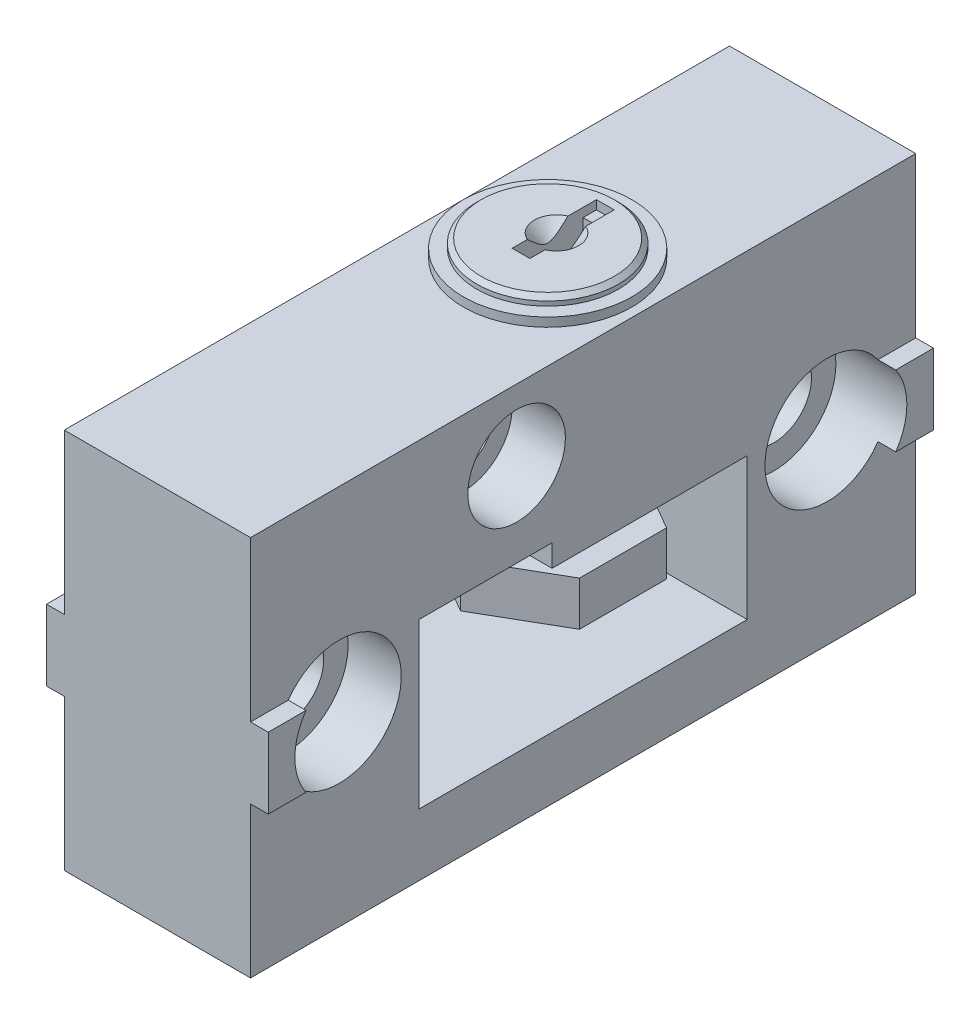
ISO-10303-21;
HEADER;
FILE_DESCRIPTION(('STEP AP214'),'2;1');
FILE_NAME('part.step','',(''),(''),'','','');
FILE_SCHEMA(('AUTOMOTIVE_DESIGN { 1 0 10303 214 1 1 1 1 }'));
ENDSEC;
DATA;
#1=APPLICATION_CONTEXT('core data for automotive mechanical design processes');
#2=APPLICATION_PROTOCOL_DEFINITION('international standard','automotive_design',2000,#1);
#3=PRODUCT_CONTEXT('',#1,'mechanical');
#4=PRODUCT('Part','Part','',(#3));
#5=PRODUCT_RELATED_PRODUCT_CATEGORY('part','',(#4));
#6=PRODUCT_DEFINITION_FORMATION('','',#4);
#7=PRODUCT_DEFINITION_CONTEXT('part definition',#1,'design');
#8=PRODUCT_DEFINITION('design','',#6,#7);
#9=PRODUCT_DEFINITION_SHAPE('','',#8);
#10=(LENGTH_UNIT() NAMED_UNIT(*) SI_UNIT(.MILLI.,.METRE.));
#11=(NAMED_UNIT(*) PLANE_ANGLE_UNIT() SI_UNIT($,.RADIAN.));
#12=(NAMED_UNIT(*) SI_UNIT($,.STERADIAN.) SOLID_ANGLE_UNIT());
#13=UNCERTAINTY_MEASURE_WITH_UNIT(LENGTH_MEASURE(1.E-05),#10,'distance_accuracy_value','');
#14=(GEOMETRIC_REPRESENTATION_CONTEXT(3) GLOBAL_UNCERTAINTY_ASSIGNED_CONTEXT((#13)) GLOBAL_UNIT_ASSIGNED_CONTEXT((#10,
#11,#12)) REPRESENTATION_CONTEXT('',''));
#15=CARTESIAN_POINT('',(0.,0.,0.));
#16=DIRECTION('',(0.,0.,1.));
#17=DIRECTION('',(1.,0.,0.));
#18=AXIS2_PLACEMENT_3D('',#15,#16,#17);
#19=CARTESIAN_POINT('',(9.49999999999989,23.0000000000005,16.));
#20=DIRECTION('',(0.,-1.,0.));
#21=DIRECTION('',(1.,0.,0.));
#22=AXIS2_PLACEMENT_3D('',#19,#20,#21);
#23=PLANE('',#22);
#24=DIRECTION('',(0.,0.,-1.));
#25=VECTOR('',#24,1.);
#26=CARTESIAN_POINT('',(11.5000000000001,23.0000000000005,24.));
#27=LINE('',#26,#25);
#28=CARTESIAN_POINT('',(11.5,23.0000000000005,16.));
#29=VERTEX_POINT('',#28);
#30=CARTESIAN_POINT('',(11.5,23.0000000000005,14.5));
#31=VERTEX_POINT('',#30);
#32=EDGE_CURVE('P0_E154',#29,#31,#27,.T.);
#33=ORIENTED_EDGE('',*,*,#32,.T.);
#34=DIRECTION('',(-1.,0.,0.));
#35=VECTOR('',#34,1.);
#36=CARTESIAN_POINT('',(11.4999999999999,23.0000000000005,14.5));
#37=LINE('',#36,#35);
#38=CARTESIAN_POINT('',(9.49999999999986,23.0000000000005,14.5));
#39=VERTEX_POINT('',#38);
#40=EDGE_CURVE('P0_E158',#31,#39,#37,.T.);
#41=ORIENTED_EDGE('',*,*,#40,.T.);
#42=DIRECTION('',(0.,0.,1.));
#43=VECTOR('',#42,1.);
#44=CARTESIAN_POINT('',(9.49999999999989,23.0000000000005,16.));
#45=LINE('',#44,#43);
#46=CARTESIAN_POINT('',(9.49999999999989,23.0000000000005,16.));
#47=VERTEX_POINT('',#46);
#48=EDGE_CURVE('P0_E571',#39,#47,#45,.T.);
#49=ORIENTED_EDGE('',*,*,#48,.T.);
#50=DIRECTION('',(-1.,0.,0.));
#51=VECTOR('',#50,1.);
#52=CARTESIAN_POINT('',(11.5,23.0000000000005,16.));
#53=LINE('',#52,#51);
#54=EDGE_CURVE('P0_E149',#47,#29,#53,.F.);
#55=ORIENTED_EDGE('',*,*,#54,.T.);
#56=EDGE_LOOP('',(#33,#41,#49,#55));
#57=FACE_BOUND('',#56,.T.);
#58=ADVANCED_FACE('P0_F15',(#57),#23,.F.);
#59=CARTESIAN_POINT('',(11.5,24.0000000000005,16.));
#60=DIRECTION('',(0.,0.,-1.));
#61=DIRECTION('',(-1.,0.,0.));
#62=AXIS2_PLACEMENT_3D('',#59,#60,#61);
#63=PLANE('',#62);
#64=DIRECTION('',(0.,1.,0.));
#65=VECTOR('',#64,1.);
#66=CARTESIAN_POINT('',(9.49999999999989,24.0000000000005,16.));
#67=LINE('',#66,#65);
#68=CARTESIAN_POINT('',(9.49999999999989,19.0000000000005,16.));
#69=VERTEX_POINT('',#68);
#70=EDGE_CURVE('P0_E587',#47,#69,#67,.F.);
#71=ORIENTED_EDGE('',*,*,#70,.T.);
#72=DIRECTION('',(1.,0.,0.));
#73=VECTOR('',#72,1.);
#74=CARTESIAN_POINT('',(11.5,19.0000000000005,16.));
#75=LINE('',#74,#73);
#76=CARTESIAN_POINT('',(11.5,19.0000000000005,16.));
#77=VERTEX_POINT('',#76);
#78=EDGE_CURVE('P0_E585',#69,#77,#75,.T.);
#79=ORIENTED_EDGE('',*,*,#78,.T.);
#80=DIRECTION('',(0.,1.,0.));
#81=VECTOR('',#80,1.);
#82=CARTESIAN_POINT('',(11.5,24.0000000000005,16.));
#83=LINE('',#82,#81);
#84=EDGE_CURVE('P0_E594',#77,#29,#83,.T.);
#85=ORIENTED_EDGE('',*,*,#84,.T.);
#86=ORIENTED_EDGE('',*,*,#54,.F.);
#87=EDGE_LOOP('',(#71,#79,#85,#86));
#88=FACE_BOUND('',#87,.T.);
#89=ADVANCED_FACE('P0_F929',(#88),#63,.F.);
#90=CARTESIAN_POINT('',(11.5,19.0000000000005,16.));
#91=DIRECTION('',(0.,-1.,0.));
#92=DIRECTION('',(1.,0.,0.));
#93=AXIS2_PLACEMENT_3D('',#90,#91,#92);
#94=PLANE('',#93);
#95=DIRECTION('',(0.,0.,1.));
#96=VECTOR('',#95,1.);
#97=CARTESIAN_POINT('',(9.49999999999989,19.0000000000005,16.));
#98=LINE('',#97,#96);
#99=CARTESIAN_POINT('',(9.49999999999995,19.0000000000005,24.));
#100=VERTEX_POINT('',#99);
#101=EDGE_CURVE('P0_E583',#69,#100,#98,.T.);
#102=ORIENTED_EDGE('',*,*,#101,.T.);
#103=DIRECTION('',(1.,0.,0.));
#104=VECTOR('',#103,1.);
#105=CARTESIAN_POINT('',(9.49999999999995,19.0000000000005,24.));
#106=LINE('',#105,#104);
#107=CARTESIAN_POINT('',(11.5000000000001,19.0000000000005,24.));
#108=VERTEX_POINT('',#107);
#109=EDGE_CURVE('P0_E578',#100,#108,#106,.T.);
#110=ORIENTED_EDGE('',*,*,#109,.T.);
#111=DIRECTION('',(0.,0.,-1.));
#112=VECTOR('',#111,1.);
#113=CARTESIAN_POINT('',(11.5000000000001,19.0000000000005,24.));
#114=LINE('',#113,#112);
#115=EDGE_CURVE('P0_E577',#108,#77,#114,.T.);
#116=ORIENTED_EDGE('',*,*,#115,.T.);
#117=ORIENTED_EDGE('',*,*,#78,.F.);
#118=EDGE_LOOP('',(#102,#110,#116,#117));
#119=FACE_BOUND('',#118,.T.);
#120=ADVANCED_FACE('P0_F694',(#119),#94,.F.);
#121=CARTESIAN_POINT('',(10.5,23.9999999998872,20.));
#122=DIRECTION('',(0.,1.,0.));
#123=DIRECTION('',(0.,0.,1.));
#124=AXIS2_PLACEMENT_3D('',#121,#122,#123);
#125=CONICAL_SURFACE('',#124,2.4999999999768,0.785398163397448);
#126=CARTESIAN_POINT('',(10.5,24.0000000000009,20.));
#127=DIRECTION('',(0.,1.,0.));
#128=DIRECTION('',(0.,0.,1.));
#129=AXIS2_PLACEMENT_3D('',#126,#127,#128);
#130=CIRCLE('',#129,2.50000000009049);
#131=CARTESIAN_POINT('',(9.49999999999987,23.9999999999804,17.7087121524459));
#132=VERTEX_POINT('',#131);
#133=CARTESIAN_POINT('',(9.49999999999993,23.9999999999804,22.2912878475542));
#134=VERTEX_POINT('',#133);
#135=EDGE_CURVE('P0_E568',#132,#134,#130,.T.);
#136=ORIENTED_EDGE('',*,*,#135,.T.);
#137=CARTESIAN_POINT('',(9.5000000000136,23.9999999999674,22.2912878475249));
#138=CARTESIAN_POINT('',(9.50000000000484,23.9380885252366,22.223716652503));
#139=CARTESIAN_POINT('',(9.50000000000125,23.8763945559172,22.1559430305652));
#140=CARTESIAN_POINT('',(9.49999999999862,23.7536145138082,22.019818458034));
#141=CARTESIAN_POINT('',(9.49999999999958,23.6925285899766,21.9514673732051));
#142=CARTESIAN_POINT('',(9.50000000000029,23.5707668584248,21.8135941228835));
#143=CARTESIAN_POINT('',(9.50000000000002,23.5100964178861,21.7440672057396));
#144=CARTESIAN_POINT('',(9.49999999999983,23.3898899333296,21.6040507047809));
#145=CARTESIAN_POINT('',(9.4999999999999,23.330353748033,21.5335612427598));
#146=CARTESIAN_POINT('',(9.49999999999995,23.222767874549,21.4032260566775));
#147=CARTESIAN_POINT('',(9.49999999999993,23.1744709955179,21.3435850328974));
#148=CARTESIAN_POINT('',(9.49999999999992,23.0794205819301,21.2230879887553));
#149=CARTESIAN_POINT('',(9.49999999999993,23.0326668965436,21.1622320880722));
#150=CARTESIAN_POINT('',(9.49999999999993,22.9414139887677,21.0389396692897));
#151=CARTESIAN_POINT('',(9.49999999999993,22.8969124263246,20.9765048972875));
#152=CARTESIAN_POINT('',(9.49999999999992,22.8112235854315,20.8494197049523));
#153=CARTESIAN_POINT('',(9.49999999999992,22.7700343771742,20.7847706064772));
#154=CARTESIAN_POINT('',(9.49999999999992,22.6933589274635,20.6533903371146));
#155=CARTESIAN_POINT('',(9.49999999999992,22.6577975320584,20.5867039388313));
#156=CARTESIAN_POINT('',(9.49999999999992,22.5947275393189,20.449572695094));
#157=CARTESIAN_POINT('',(9.49999999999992,22.5672052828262,20.3791344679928));
#158=CARTESIAN_POINT('',(9.49999999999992,22.5290938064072,20.2491004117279));
#159=CARTESIAN_POINT('',(9.49999999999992,22.5162002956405,20.1902095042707));
#160=CARTESIAN_POINT('',(9.49999999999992,22.5008070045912,20.0711688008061));
#161=CARTESIAN_POINT('',(9.49999999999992,22.49827742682,20.0110231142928));
#162=CARTESIAN_POINT('',(9.49999999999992,22.5041059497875,19.8913081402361));
#163=CARTESIAN_POINT('',(9.49999999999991,22.5124621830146,19.8317387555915));
#164=CARTESIAN_POINT('',(9.49999999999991,22.5383565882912,19.7145456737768));
#165=CARTESIAN_POINT('',(9.49999999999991,22.5559246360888,19.6569289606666));
#166=CARTESIAN_POINT('',(9.49999999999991,22.6028634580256,19.5303340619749));
#167=CARTESIAN_POINT('',(9.49999999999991,22.6340774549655,19.4620634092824));
#168=CARTESIAN_POINT('',(9.49999999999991,22.703004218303,19.3288250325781));
#169=CARTESIAN_POINT('',(9.49999999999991,22.7407320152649,19.2638654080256));
#170=CARTESIAN_POINT('',(9.49999999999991,22.8206962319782,19.1358487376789));
#171=CARTESIAN_POINT('',(9.49999999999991,22.8629768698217,19.0728197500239));
#172=CARTESIAN_POINT('',(9.49999999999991,22.9502861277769,18.9486836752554));
#173=CARTESIAN_POINT('',(9.49999999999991,22.9953158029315,18.8875773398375));
#174=CARTESIAN_POINT('',(9.49999999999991,23.1171517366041,18.7274417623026));
#175=CARTESIAN_POINT('',(9.49999999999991,23.1955532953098,18.6296334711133));
#176=CARTESIAN_POINT('',(9.4999999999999,23.3552757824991,18.4363612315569));
#177=CARTESIAN_POINT('',(9.4999999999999,23.4365985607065,18.3408988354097));
#178=CARTESIAN_POINT('',(9.4999999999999,23.5977362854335,18.1554085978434));
#179=CARTESIAN_POINT('',(9.4999999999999,23.6774785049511,18.0653174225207));
#180=CARTESIAN_POINT('',(9.4999999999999,23.7979034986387,17.9310031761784));
#181=CARTESIAN_POINT('',(9.4999999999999,23.8381575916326,17.886393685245));
#182=CARTESIAN_POINT('',(9.4999999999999,23.918907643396,17.7973962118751));
#183=CARTESIAN_POINT('',(9.4999999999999,23.9594035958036,17.7530082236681));
#184=CARTESIAN_POINT('',(9.4999999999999,23.9999999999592,17.7087121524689));
#185=B_SPLINE_CURVE_WITH_KNOTS('',3,(#137,#138,#139,#140,#141,#142,#143,#144,#145,#146,#147,
#148,#149,#150,#151,#152,#153,#154,#155,#156,#157,#158,#159,#160,#161,#162,#163,#164,#165,#166,
#167,#168,#169,#170,#171,#172,#173,#174,#175,#176,#177,#178,#179,#180,#181,#182,#183,#184),
.UNSPECIFIED.,.F.,.F.,(4,2,2,2,2,2,2,2,2,2,2,2,2,2,2,2,2,2,2,2,2,2,2,4),(0.,0.274939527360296,
0.549944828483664,0.826765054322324,1.1035505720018,1.33376504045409,1.56395694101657,
1.793904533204,2.02371717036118,2.25014025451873,2.47617635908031,2.65628592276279,
2.83587728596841,3.01543784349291,3.19558438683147,3.42021320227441,3.64536744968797,
3.87294882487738,4.10061809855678,4.47656476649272,4.85275383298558,5.21367732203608,
5.39393658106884,5.57419111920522),.UNSPECIFIED.);
#186=EDGE_CURVE('P0_E582',#134,#132,#185,.T.);
#187=ORIENTED_EDGE('',*,*,#186,.T.);
#188=EDGE_LOOP('',(#136,#187));
#189=FACE_BOUND('',#188,.T.);
#190=ADVANCED_FACE('P0_F666',(#189),#125,.F.);
#191=CARTESIAN_POINT('',(9.49999999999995,24.0000000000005,24.));
#192=DIRECTION('',(0.,0.,1.));
#193=DIRECTION('',(1.,0.,0.));
#194=AXIS2_PLACEMENT_3D('',#191,#192,#193);
#195=PLANE('',#194);
#196=DIRECTION('',(0.,1.,0.));
#197=VECTOR('',#196,1.);
#198=CARTESIAN_POINT('',(9.49999999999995,24.0000000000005,24.));
#199=LINE('',#198,#197);
#200=CARTESIAN_POINT('',(9.49999999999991,24.0000000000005,24.));
#201=VERTEX_POINT('',#200);
#202=EDGE_CURVE('P0_E580',#100,#201,#199,.T.);
#203=ORIENTED_EDGE('',*,*,#202,.T.);
#204=DIRECTION('',(1.,0.,0.));
#205=VECTOR('',#204,1.);
#206=CARTESIAN_POINT('',(10.5,24.0000000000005,24.));
#207=LINE('',#206,#205);
#208=CARTESIAN_POINT('',(11.5000000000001,24.0000000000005,24.));
#209=VERTEX_POINT('',#208);
#210=EDGE_CURVE('P0_E127',#201,#209,#207,.T.);
#211=ORIENTED_EDGE('',*,*,#210,.T.);
#212=DIRECTION('',(0.,1.,0.));
#213=VECTOR('',#212,1.);
#214=CARTESIAN_POINT('',(11.5000000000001,24.0000000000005,24.));
#215=LINE('',#214,#213);
#216=EDGE_CURVE('P0_E575',#209,#108,#215,.F.);
#217=ORIENTED_EDGE('',*,*,#216,.T.);
#218=ORIENTED_EDGE('',*,*,#109,.F.);
#219=EDGE_LOOP('',(#203,#211,#217,#218));
#220=FACE_BOUND('',#219,.T.);
#221=ADVANCED_FACE('P0_F688',(#220),#195,.F.);
#222=CARTESIAN_POINT('',(10.5,23.9999999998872,20.));
#223=DIRECTION('',(0.,1.,0.));
#224=DIRECTION('',(0.,0.,1.));
#225=AXIS2_PLACEMENT_3D('',#222,#223,#224);
#226=CONICAL_SURFACE('',#225,2.4999999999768,0.785398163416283);
#227=CARTESIAN_POINT('',(10.5,23.9999999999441,20.));
#228=DIRECTION('',(0.,1.,0.));
#229=DIRECTION('',(0.,0.,1.));
#230=AXIS2_PLACEMENT_3D('',#227,#228,#229);
#231=CIRCLE('',#230,2.50000000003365);
#232=CARTESIAN_POINT('',(11.5000000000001,23.9999999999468,22.2912878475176));
#233=VERTEX_POINT('',#232);
#234=CARTESIAN_POINT('',(11.5,23.9999999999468,17.7087121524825));
#235=VERTEX_POINT('',#234);
#236=EDGE_CURVE('P0_E114',#233,#235,#231,.T.);
#237=ORIENTED_EDGE('',*,*,#236,.T.);
#238=CARTESIAN_POINT('',(11.5,23.9999999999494,17.7087121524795));
#239=CARTESIAN_POINT('',(11.5,23.9380885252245,17.7762833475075));
#240=CARTESIAN_POINT('',(11.5,23.8763945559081,17.8440569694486));
#241=CARTESIAN_POINT('',(11.5,23.7536145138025,17.9801815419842));
#242=CARTESIAN_POINT('',(11.5,23.6925285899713,18.0485326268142));
#243=CARTESIAN_POINT('',(11.5,23.570766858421,18.1864058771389));
#244=CARTESIAN_POINT('',(11.5,23.5100964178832,18.2559327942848));
#245=CARTESIAN_POINT('',(11.5,23.3898899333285,18.3959492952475));
#246=CARTESIAN_POINT('',(11.5,23.3303537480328,18.4664387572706));
#247=CARTESIAN_POINT('',(11.5,23.2227678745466,18.5967739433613));
#248=CARTESIAN_POINT('',(11.5,23.1744709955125,18.656414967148));
#249=CARTESIAN_POINT('',(11.5,23.079420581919,18.7769120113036));
#250=CARTESIAN_POINT('',(11.5,23.03266689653,18.8377679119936));
#251=CARTESIAN_POINT('',(11.5,22.9414139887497,18.9610603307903));
#252=CARTESIAN_POINT('',(11.5,22.8969124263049,19.0234951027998));
#253=CARTESIAN_POINT('',(11.5,22.8112235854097,19.1505802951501));
#254=CARTESIAN_POINT('',(11.5,22.7700343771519,19.2152293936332));
#255=CARTESIAN_POINT('',(11.5,22.6933589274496,19.3466096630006));
#256=CARTESIAN_POINT('',(11.5,22.6577975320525,19.4132960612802));
#257=CARTESIAN_POINT('',(11.5,22.5947275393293,19.5504273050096));
#258=CARTESIAN_POINT('',(11.5,22.5672052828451,19.6208655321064));
#259=CARTESIAN_POINT('',(11.5,22.5290938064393,19.7508995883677));
#260=CARTESIAN_POINT('',(11.5,22.5162002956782,19.809790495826));
#261=CARTESIAN_POINT('',(11.5,22.5008070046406,19.9288311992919));
#262=CARTESIAN_POINT('',(11.5,22.4982774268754,19.9889768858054));
#263=CARTESIAN_POINT('',(11.5,22.5041059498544,20.108691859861));
#264=CARTESIAN_POINT('',(11.5,22.5124621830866,20.1682612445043));
#265=CARTESIAN_POINT('',(11.5,22.5383565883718,20.2854543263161));
#266=CARTESIAN_POINT('',(11.5,22.555924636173,20.3430710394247));
#267=CARTESIAN_POINT('',(11.5,22.6028634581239,20.4696659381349));
#268=CARTESIAN_POINT('',(11.5,22.6340774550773,20.5379365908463));
#269=CARTESIAN_POINT('',(11.5,22.7030042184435,20.6711749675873));
#270=CARTESIAN_POINT('',(11.5,22.7407320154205,20.7361345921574));
#271=CARTESIAN_POINT('',(11.5,22.8206962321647,20.8641512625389));
#272=CARTESIAN_POINT('',(11.5,22.8629768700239,20.9271802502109));
#273=CARTESIAN_POINT('',(11.5,22.9502861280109,21.0513163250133));
#274=CARTESIAN_POINT('',(11.5,22.9953158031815,21.112422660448));
#275=CARTESIAN_POINT('',(11.5,23.1171517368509,21.2725582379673));
#276=CARTESIAN_POINT('',(11.5,23.1955532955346,21.3703665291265));
#277=CARTESIAN_POINT('',(11.5,23.355275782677,21.5636387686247));
#278=CARTESIAN_POINT('',(11.5,23.4365985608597,21.659101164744));
#279=CARTESIAN_POINT('',(11.5,23.5977362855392,21.8445914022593));
#280=CARTESIAN_POINT('',(11.5,23.677478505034,21.9346825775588));
#281=CARTESIAN_POINT('',(11.5,23.7979034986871,22.068996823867));
#282=CARTESIAN_POINT('',(11.5,23.8381575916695,22.1136063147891));
#283=CARTESIAN_POINT('',(11.5,23.9189076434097,22.2026037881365));
#284=CARTESIAN_POINT('',(11.5,23.9594035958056,22.2469917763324));
#285=CARTESIAN_POINT('',(11.5,23.9999999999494,22.2912878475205));
#286=B_SPLINE_CURVE_WITH_KNOTS('',3,(#238,#239,#240,#241,#242,#243,#244,#245,#246,#247,#248,
#249,#250,#251,#252,#253,#254,#255,#256,#257,#258,#259,#260,#261,#262,#263,#264,#265,#266,#267,
#268,#269,#270,#271,#272,#273,#274,#275,#276,#277,#278,#279,#280,#281,#282,#283,#284,#285),
.UNSPECIFIED.,.F.,.F.,(4,2,2,2,2,2,2,2,2,2,2,2,2,2,2,2,2,2,2,2,2,2,2,4),(0.,0.274939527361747,
0.549944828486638,0.826765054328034,1.1035505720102,1.33376504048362,1.56395694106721,
1.7939045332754,2.02371717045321,2.25014025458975,2.47617635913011,2.65628592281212,
2.83587728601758,3.01543784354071,3.19558438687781,3.42021320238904,3.64536744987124,
3.87294882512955,4.10061809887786,4.47656476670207,4.85275383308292,5.21367732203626,
5.39393658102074,5.57419111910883),.UNSPECIFIED.);
#287=EDGE_CURVE('P0_E18',#235,#233,#286,.T.);
#288=ORIENTED_EDGE('',*,*,#287,.T.);
#289=EDGE_LOOP('',(#237,#288));
#290=FACE_BOUND('',#289,.T.);
#291=ADVANCED_FACE('P0_F684',(#290),#226,.F.);
#292=CARTESIAN_POINT('',(11.5000000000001,24.0000000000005,24.));
#293=DIRECTION('',(1.,0.,0.));
#294=DIRECTION('',(0.,0.,-1.));
#295=AXIS2_PLACEMENT_3D('',#292,#293,#294);
#296=PLANE('',#295);
#297=DIRECTION('',(0.,0.,1.));
#298=VECTOR('',#297,1.);
#299=CARTESIAN_POINT('',(11.5000000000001,24.0000000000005,21.));
#300=LINE('',#299,#298);
#301=CARTESIAN_POINT('',(11.5,24.0000000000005,14.5));
#302=VERTEX_POINT('',#301);
#303=EDGE_CURVE('P0_E561',#235,#302,#300,.F.);
#304=ORIENTED_EDGE('',*,*,#303,.T.);
#305=DIRECTION('',(0.,1.,0.));
#306=VECTOR('',#305,1.);
#307=CARTESIAN_POINT('',(11.4999999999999,24.0000000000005,14.5));
#308=LINE('',#307,#306);
#309=EDGE_CURVE('P0_E573',#302,#31,#308,.F.);
#310=ORIENTED_EDGE('',*,*,#309,.T.);
#311=ORIENTED_EDGE('',*,*,#32,.F.);
#312=ORIENTED_EDGE('',*,*,#84,.F.);
#313=ORIENTED_EDGE('',*,*,#115,.F.);
#314=ORIENTED_EDGE('',*,*,#216,.F.);
#315=DIRECTION('',(0.,0.,1.));
#316=VECTOR('',#315,1.);
#317=CARTESIAN_POINT('',(11.5000000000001,24.0000000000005,21.));
#318=LINE('',#317,#316);
#319=EDGE_CURVE('P0_E563',#209,#233,#318,.F.);
#320=ORIENTED_EDGE('',*,*,#319,.T.);
#321=ORIENTED_EDGE('',*,*,#287,.F.);
#322=EDGE_LOOP('',(#304,#310,#311,#312,#313,#314,#320,#321));
#323=FACE_BOUND('',#322,.T.);
#324=ADVANCED_FACE('P0_F680',(#323),#296,.F.);
#325=CARTESIAN_POINT('',(11.4999999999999,24.0000000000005,14.5));
#326=DIRECTION('',(0.,0.,-1.));
#327=DIRECTION('',(-1.,0.,0.));
#328=AXIS2_PLACEMENT_3D('',#325,#326,#327);
#329=PLANE('',#328);
#330=ORIENTED_EDGE('',*,*,#309,.F.);
#331=DIRECTION('',(1.,0.,0.));
#332=VECTOR('',#331,1.);
#333=CARTESIAN_POINT('',(10.5,24.0000000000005,14.5));
#334=LINE('',#333,#332);
#335=CARTESIAN_POINT('',(9.49999999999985,24.0000000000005,14.5));
#336=VERTEX_POINT('',#335);
#337=EDGE_CURVE('P0_E560',#302,#336,#334,.F.);
#338=ORIENTED_EDGE('',*,*,#337,.T.);
#339=DIRECTION('',(0.,1.,0.));
#340=VECTOR('',#339,1.);
#341=CARTESIAN_POINT('',(9.49999999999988,24.0000000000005,14.5));
#342=LINE('',#341,#340);
#343=EDGE_CURVE('P0_E569',#336,#39,#342,.F.);
#344=ORIENTED_EDGE('',*,*,#343,.T.);
#345=ORIENTED_EDGE('',*,*,#40,.F.);
#346=EDGE_LOOP('',(#330,#338,#344,#345));
#347=FACE_BOUND('',#346,.T.);
#348=ADVANCED_FACE('P0_F676',(#347),#329,.F.);
#349=CARTESIAN_POINT('',(9.49999999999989,24.0000000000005,16.));
#350=DIRECTION('',(-1.,0.,0.));
#351=DIRECTION('',(0.,0.,1.));
#352=AXIS2_PLACEMENT_3D('',#349,#350,#351);
#353=PLANE('',#352);
#354=DIRECTION('',(0.,0.,1.));
#355=VECTOR('',#354,1.);
#356=CARTESIAN_POINT('',(9.49999999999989,24.0000000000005,21.));
#357=LINE('',#356,#355);
#358=EDGE_CURVE('P0_E565',#134,#201,#357,.T.);
#359=ORIENTED_EDGE('',*,*,#358,.T.);
#360=ORIENTED_EDGE('',*,*,#202,.F.);
#361=ORIENTED_EDGE('',*,*,#101,.F.);
#362=ORIENTED_EDGE('',*,*,#70,.F.);
#363=ORIENTED_EDGE('',*,*,#48,.F.);
#364=ORIENTED_EDGE('',*,*,#343,.F.);
#365=DIRECTION('',(0.,0.,1.));
#366=VECTOR('',#365,1.);
#367=CARTESIAN_POINT('',(9.49999999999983,24.0000000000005,21.));
#368=LINE('',#367,#366);
#369=EDGE_CURVE('P0_E557',#336,#132,#368,.T.);
#370=ORIENTED_EDGE('',*,*,#369,.T.);
#371=ORIENTED_EDGE('',*,*,#186,.F.);
#372=EDGE_LOOP('',(#359,#360,#361,#362,#363,#364,#370,#371));
#373=FACE_BOUND('',#372,.T.);
#374=ADVANCED_FACE('P0_F670',(#373),#353,.F.);
#375=CARTESIAN_POINT('',(10.5,24.0000000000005,21.));
#376=DIRECTION('',(0.,-1.,0.));
#377=DIRECTION('',(1.,0.,0.));
#378=AXIS2_PLACEMENT_3D('',#375,#376,#377);
#379=PLANE('',#378);
#380=CARTESIAN_POINT('',(10.5,24.0000000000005,21.));
#381=DIRECTION('',(0.,-1.,0.));
#382=DIRECTION('',(0.,0.,-1.));
#383=AXIS2_PLACEMENT_3D('',#380,#381,#382);
#384=CIRCLE('',#383,7.5);
#385=CARTESIAN_POINT('',(10.5,24.0000000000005,13.5));
#386=VERTEX_POINT('',#385);
#387=EDGE_CURVE('P0_E554',#386,#386,#384,.T.);
#388=ORIENTED_EDGE('',*,*,#387,.F.);
#389=EDGE_LOOP('',(#388));
#390=FACE_BOUND('',#389,.T.);
#391=ORIENTED_EDGE('',*,*,#337,.F.);
#392=ORIENTED_EDGE('',*,*,#303,.F.);
#393=ORIENTED_EDGE('',*,*,#236,.F.);
#394=ORIENTED_EDGE('',*,*,#319,.F.);
#395=ORIENTED_EDGE('',*,*,#210,.F.);
#396=ORIENTED_EDGE('',*,*,#358,.F.);
#397=ORIENTED_EDGE('',*,*,#135,.F.);
#398=ORIENTED_EDGE('',*,*,#369,.F.);
#399=EDGE_LOOP('',(#391,#392,#393,#394,#395,#396,#397,#398));
#400=FACE_BOUND('',#399,.T.);
#401=ADVANCED_FACE('P0_F675',(#390,#400),#379,.F.);
#402=CARTESIAN_POINT('',(19.,-7.49999999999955,25.9074772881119));
#403=DIRECTION('',(0.,1.,0.));
#404=DIRECTION('',(0.,0.,1.));
#405=AXIS2_PLACEMENT_3D('',#402,#403,#404);
#406=PLANE('',#405);
#407=DIRECTION('',(0.866025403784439,0.,-0.5));
#408=VECTOR('',#407,1.);
#409=CARTESIAN_POINT('',(10.5,-7.49999999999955,30.8149545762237));
#410=LINE('',#409,#408);
#411=CARTESIAN_POINT('',(10.5,-7.49999999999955,30.8149545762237));
#412=VERTEX_POINT('',#411);
#413=CARTESIAN_POINT('',(19.,-7.49999999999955,25.9074772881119));
#414=VERTEX_POINT('',#413);
#415=EDGE_CURVE('P0_E530',#412,#414,#410,.T.);
#416=ORIENTED_EDGE('',*,*,#415,.F.);
#417=DIRECTION('',(0.866025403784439,0.,0.5));
#418=VECTOR('',#417,1.);
#419=CARTESIAN_POINT('',(2.,-7.49999999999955,25.9074772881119));
#420=LINE('',#419,#418);
#421=CARTESIAN_POINT('',(2.,-7.49999999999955,25.9074772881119));
#422=VERTEX_POINT('',#421);
#423=EDGE_CURVE('P0_E536',#422,#412,#420,.T.);
#424=ORIENTED_EDGE('',*,*,#423,.F.);
#425=DIRECTION('',(0.,0.,1.));
#426=VECTOR('',#425,1.);
#427=CARTESIAN_POINT('',(2.,-7.49999999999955,16.0925227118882));
#428=LINE('',#427,#426);
#429=CARTESIAN_POINT('',(2.,-7.49999999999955,16.0925227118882));
#430=VERTEX_POINT('',#429);
#431=EDGE_CURVE('P0_E542',#430,#422,#428,.T.);
#432=ORIENTED_EDGE('',*,*,#431,.F.);
#433=DIRECTION('',(-0.866025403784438,0.,0.500000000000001));
#434=VECTOR('',#433,1.);
#435=CARTESIAN_POINT('',(10.5,-7.49999999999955,11.1850454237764));
#436=LINE('',#435,#434);
#437=CARTESIAN_POINT('',(10.5,-7.49999999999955,11.1850454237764));
#438=VERTEX_POINT('',#437);
#439=EDGE_CURVE('P0_E548',#438,#430,#436,.T.);
#440=ORIENTED_EDGE('',*,*,#439,.F.);
#441=DIRECTION('',(-0.866025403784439,0.,-0.499999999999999));
#442=VECTOR('',#441,1.);
#443=CARTESIAN_POINT('',(19.,-7.49999999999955,16.0925227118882));
#444=LINE('',#443,#442);
#445=CARTESIAN_POINT('',(19.,-7.49999999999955,16.0925227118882));
#446=VERTEX_POINT('',#445);
#447=EDGE_CURVE('P0_E551',#446,#438,#444,.T.);
#448=ORIENTED_EDGE('',*,*,#447,.F.);
#449=DIRECTION('',(0.,0.,1.));
#450=VECTOR('',#449,1.);
#451=CARTESIAN_POINT('',(19.,-7.49999999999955,25.9074772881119));
#452=LINE('',#451,#450);
#453=EDGE_CURVE('P0_E524',#414,#446,#452,.F.);
#454=ORIENTED_EDGE('',*,*,#453,.F.);
#455=EDGE_LOOP('',(#416,#424,#432,#440,#448,#454));
#456=FACE_BOUND('',#455,.T.);
#457=ADVANCED_FACE('P0_F897',(#456),#406,.F.);
#458=CARTESIAN_POINT('',(10.5,23.5000000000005,21.));
#459=DIRECTION('',(0.,-1.,0.));
#460=DIRECTION('',(0.,0.,-1.));
#461=AXIS2_PLACEMENT_3D('',#458,#459,#460);
#462=CONICAL_SURFACE('',#461,8.,0.785398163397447);
#463=ORIENTED_EDGE('',*,*,#387,.T.);
#464=EDGE_LOOP('',(#463));
#465=FACE_BOUND('',#464,.T.);
#466=CARTESIAN_POINT('',(10.5,23.5000000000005,21.));
#467=DIRECTION('',(0.,-1.,0.));
#468=DIRECTION('',(1.,0.,0.));
#469=AXIS2_PLACEMENT_3D('',#466,#467,#468);
#470=CIRCLE('',#469,8.);
#471=CARTESIAN_POINT('',(18.5,23.5000000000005,21.));
#472=VERTEX_POINT('',#471);
#473=EDGE_CURVE('P0_E517',#472,#472,#470,.T.);
#474=ORIENTED_EDGE('',*,*,#473,.F.);
#475=EDGE_LOOP('',(#474));
#476=FACE_BOUND('',#475,.T.);
#477=ADVANCED_FACE('P0_F894',(#465,#476),#462,.T.);
#478=CARTESIAN_POINT('',(19.,-2.49999999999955,16.0925227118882));
#479=DIRECTION('',(0.499999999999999,0.,-0.866025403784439));
#480=DIRECTION('',(-0.866025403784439,0.,-0.499999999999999));
#481=AXIS2_PLACEMENT_3D('',#478,#479,#480);
#482=PLANE('',#481);
#483=DIRECTION('',(-0.866025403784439,0.,-0.499999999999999));
#484=VECTOR('',#483,1.);
#485=CARTESIAN_POINT('',(19.,-2.49999999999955,16.0925227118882));
#486=LINE('',#485,#484);
#487=CARTESIAN_POINT('',(19.,-2.49999999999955,16.0925227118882));
#488=VERTEX_POINT('',#487);
#489=CARTESIAN_POINT('',(10.5,-2.49999999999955,11.1850454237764));
#490=VERTEX_POINT('',#489);
#491=EDGE_CURVE('P0_E514',#488,#490,#486,.T.);
#492=ORIENTED_EDGE('',*,*,#491,.F.);
#493=DIRECTION('',(0.,1.,0.));
#494=VECTOR('',#493,1.);
#495=CARTESIAN_POINT('',(19.,-2.49999999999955,16.0925227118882));
#496=LINE('',#495,#494);
#497=EDGE_CURVE('P0_E521',#446,#488,#496,.T.);
#498=ORIENTED_EDGE('',*,*,#497,.F.);
#499=ORIENTED_EDGE('',*,*,#447,.T.);
#500=DIRECTION('',(0.,1.,0.));
#501=VECTOR('',#500,1.);
#502=CARTESIAN_POINT('',(10.5,-2.49999999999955,11.1850454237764));
#503=LINE('',#502,#501);
#504=EDGE_CURVE('P0_E545',#490,#438,#503,.F.);
#505=ORIENTED_EDGE('',*,*,#504,.F.);
#506=EDGE_LOOP('',(#492,#498,#499,#505));
#507=FACE_BOUND('',#506,.T.);
#508=ADVANCED_FACE('P0_F890',(#507),#482,.T.);
#509=CARTESIAN_POINT('',(10.5,-2.49999999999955,11.1850454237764));
#510=DIRECTION('',(-0.500000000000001,0.,-0.866025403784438));
#511=DIRECTION('',(-0.866025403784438,0.,0.500000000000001));
#512=AXIS2_PLACEMENT_3D('',#509,#510,#511);
#513=PLANE('',#512);
#514=DIRECTION('',(-0.866025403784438,0.,0.500000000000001));
#515=VECTOR('',#514,1.);
#516=CARTESIAN_POINT('',(10.5,-2.49999999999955,11.1850454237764));
#517=LINE('',#516,#515);
#518=CARTESIAN_POINT('',(2.,-2.49999999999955,16.0925227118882));
#519=VERTEX_POINT('',#518);
#520=EDGE_CURVE('P0_E511',#490,#519,#517,.T.);
#521=ORIENTED_EDGE('',*,*,#520,.F.);
#522=ORIENTED_EDGE('',*,*,#504,.T.);
#523=ORIENTED_EDGE('',*,*,#439,.T.);
#524=DIRECTION('',(0.,-1.,0.));
#525=VECTOR('',#524,1.);
#526=CARTESIAN_POINT('',(2.,-2.49999999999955,16.0925227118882));
#527=LINE('',#526,#525);
#528=EDGE_CURVE('P0_E539',#519,#430,#527,.T.);
#529=ORIENTED_EDGE('',*,*,#528,.F.);
#530=EDGE_LOOP('',(#521,#522,#523,#529));
#531=FACE_BOUND('',#530,.T.);
#532=ADVANCED_FACE('P0_F886',(#531),#513,.T.);
#533=CARTESIAN_POINT('',(2.,-2.49999999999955,16.0925227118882));
#534=DIRECTION('',(-1.,0.,0.));
#535=DIRECTION('',(0.,-1.,0.));
#536=AXIS2_PLACEMENT_3D('',#533,#534,#535);
#537=PLANE('',#536);
#538=DIRECTION('',(0.,0.,1.));
#539=VECTOR('',#538,1.);
#540=CARTESIAN_POINT('',(2.,-2.49999999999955,21.));
#541=LINE('',#540,#539);
#542=CARTESIAN_POINT('',(2.,-2.49999999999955,25.9074772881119));
#543=VERTEX_POINT('',#542);
#544=EDGE_CURVE('P0_E508',#519,#543,#541,.T.);
#545=ORIENTED_EDGE('',*,*,#544,.F.);
#546=ORIENTED_EDGE('',*,*,#528,.T.);
#547=ORIENTED_EDGE('',*,*,#431,.T.);
#548=DIRECTION('',(0.,1.,0.));
#549=VECTOR('',#548,1.);
#550=CARTESIAN_POINT('',(2.,-2.49999999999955,25.9074772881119));
#551=LINE('',#550,#549);
#552=EDGE_CURVE('P0_E533',#543,#422,#551,.F.);
#553=ORIENTED_EDGE('',*,*,#552,.F.);
#554=EDGE_LOOP('',(#545,#546,#547,#553));
#555=FACE_BOUND('',#554,.T.);
#556=ADVANCED_FACE('P0_F882',(#555),#537,.T.);
#557=CARTESIAN_POINT('',(2.,-2.49999999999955,25.9074772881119));
#558=DIRECTION('',(-0.5,0.,0.866025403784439));
#559=DIRECTION('',(0.866025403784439,0.,0.5));
#560=AXIS2_PLACEMENT_3D('',#557,#558,#559);
#561=PLANE('',#560);
#562=DIRECTION('',(0.866025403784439,0.,0.499999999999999));
#563=VECTOR('',#562,1.);
#564=CARTESIAN_POINT('',(2.,-2.49999999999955,25.9074772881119));
#565=LINE('',#564,#563);
#566=CARTESIAN_POINT('',(10.5,-2.49999999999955,30.8149545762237));
#567=VERTEX_POINT('',#566);
#568=EDGE_CURVE('P0_E505',#543,#567,#565,.T.);
#569=ORIENTED_EDGE('',*,*,#568,.F.);
#570=ORIENTED_EDGE('',*,*,#552,.T.);
#571=ORIENTED_EDGE('',*,*,#423,.T.);
#572=DIRECTION('',(0.,1.,0.));
#573=VECTOR('',#572,1.);
#574=CARTESIAN_POINT('',(10.5,-2.49999999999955,30.8149545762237));
#575=LINE('',#574,#573);
#576=EDGE_CURVE('P0_E527',#567,#412,#575,.F.);
#577=ORIENTED_EDGE('',*,*,#576,.F.);
#578=EDGE_LOOP('',(#569,#570,#571,#577));
#579=FACE_BOUND('',#578,.T.);
#580=ADVANCED_FACE('P0_F878',(#579),#561,.T.);
#581=CARTESIAN_POINT('',(10.5,-2.49999999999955,30.8149545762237));
#582=DIRECTION('',(0.5,0.,0.866025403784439));
#583=DIRECTION('',(0.866025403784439,0.,-0.5));
#584=AXIS2_PLACEMENT_3D('',#581,#582,#583);
#585=PLANE('',#584);
#586=DIRECTION('',(0.866025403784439,0.,-0.499999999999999));
#587=VECTOR('',#586,1.);
#588=CARTESIAN_POINT('',(10.5,-2.49999999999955,30.8149545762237));
#589=LINE('',#588,#587);
#590=CARTESIAN_POINT('',(19.,-2.49999999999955,25.9074772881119));
#591=VERTEX_POINT('',#590);
#592=EDGE_CURVE('P0_E502',#567,#591,#589,.T.);
#593=ORIENTED_EDGE('',*,*,#592,.F.);
#594=ORIENTED_EDGE('',*,*,#576,.T.);
#595=ORIENTED_EDGE('',*,*,#415,.T.);
#596=DIRECTION('',(0.,1.,0.));
#597=VECTOR('',#596,1.);
#598=CARTESIAN_POINT('',(19.,-2.49999999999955,25.9074772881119));
#599=LINE('',#598,#597);
#600=EDGE_CURVE('P0_E518',#591,#414,#599,.F.);
#601=ORIENTED_EDGE('',*,*,#600,.F.);
#602=EDGE_LOOP('',(#593,#594,#595,#601));
#603=FACE_BOUND('',#602,.T.);
#604=ADVANCED_FACE('P0_F874',(#603),#585,.T.);
#605=CARTESIAN_POINT('',(19.,-2.49999999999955,25.9074772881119));
#606=DIRECTION('',(1.,0.,0.));
#607=DIRECTION('',(0.,1.,0.));
#608=AXIS2_PLACEMENT_3D('',#605,#606,#607);
#609=PLANE('',#608);
#610=DIRECTION('',(0.,0.,1.));
#611=VECTOR('',#610,1.);
#612=CARTESIAN_POINT('',(19.,-2.49999999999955,21.));
#613=LINE('',#612,#611);
#614=EDGE_CURVE('P0_E498',#591,#488,#613,.F.);
#615=ORIENTED_EDGE('',*,*,#614,.F.);
#616=ORIENTED_EDGE('',*,*,#600,.T.);
#617=ORIENTED_EDGE('',*,*,#453,.T.);
#618=ORIENTED_EDGE('',*,*,#497,.T.);
#619=EDGE_LOOP('',(#615,#616,#617,#618));
#620=FACE_BOUND('',#619,.T.);
#621=ADVANCED_FACE('P0_F870',(#620),#609,.T.);
#622=CARTESIAN_POINT('',(10.5,24.0000000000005,21.));
#623=DIRECTION('',(0.,-1.,0.));
#624=DIRECTION('',(1.,0.,0.));
#625=AXIS2_PLACEMENT_3D('',#622,#623,#624);
#626=CYLINDRICAL_SURFACE('',#625,8.);
#627=CARTESIAN_POINT('',(10.5,23.0000000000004,21.));
#628=DIRECTION('',(0.,-1.,0.));
#629=DIRECTION('',(1.,0.,0.));
#630=AXIS2_PLACEMENT_3D('',#627,#628,#629);
#631=CIRCLE('',#630,8.);
#632=CARTESIAN_POINT('',(18.5,23.0000000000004,21.));
#633=VERTEX_POINT('',#632);
#634=EDGE_CURVE('P0_E650',#633,#633,#631,.F.);
#635=ORIENTED_EDGE('',*,*,#634,.T.);
#636=EDGE_LOOP('',(#635));
#637=FACE_BOUND('',#636,.T.);
#638=ORIENTED_EDGE('',*,*,#473,.T.);
#639=EDGE_LOOP('',(#638));
#640=FACE_BOUND('',#639,.T.);
#641=ADVANCED_FACE('P0_F866',(#637,#640),#626,.T.);
#642=CARTESIAN_POINT('',(6.,-7.,0.));
#643=DIRECTION('',(-1.,0.,0.));
#644=DIRECTION('',(0.,-1.,0.));
#645=AXIS2_PLACEMENT_3D('',#642,#643,#644);
#646=PLANE('',#645);
#647=CARTESIAN_POINT('',(6.,0.,0.));
#648=DIRECTION('',(1.,0.,0.));
#649=DIRECTION('',(0.,1.,0.));
#650=AXIS2_PLACEMENT_3D('',#647,#648,#649);
#651=CIRCLE('',#650,7.);
#652=CARTESIAN_POINT('',(6.,7.,0.));
#653=VERTEX_POINT('',#652);
#654=EDGE_CURVE('P0_E647',#653,#653,#651,.F.);
#655=ORIENTED_EDGE('',*,*,#654,.T.);
#656=EDGE_LOOP('',(#655));
#657=FACE_BOUND('',#656,.T.);
#658=CARTESIAN_POINT('',(6.,0.,0.));
#659=DIRECTION('',(1.,0.,0.));
#660=DIRECTION('',(0.,1.,0.));
#661=AXIS2_PLACEMENT_3D('',#658,#659,#660);
#662=CIRCLE('',#661,4.25);
#663=CARTESIAN_POINT('',(6.,4.25,0.));
#664=VERTEX_POINT('',#663);
#665=EDGE_CURVE('P0_E653',#664,#664,#662,.T.);
#666=ORIENTED_EDGE('',*,*,#665,.T.);
#667=EDGE_LOOP('',(#666));
#668=FACE_BOUND('',#667,.T.);
#669=ADVANCED_FACE('P0_F862',(#657,#668),#646,.T.);
#670=CARTESIAN_POINT('',(6.,8.50000000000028,35.));
#671=DIRECTION('',(-1.,0.,0.));
#672=DIRECTION('',(0.,-1.,0.));
#673=AXIS2_PLACEMENT_3D('',#670,#671,#672);
#674=PLANE('',#673);
#675=CARTESIAN_POINT('',(6.,14.0000000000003,35.));
#676=DIRECTION('',(1.,0.,0.));
#677=DIRECTION('',(0.,1.,0.));
#678=AXIS2_PLACEMENT_3D('',#675,#676,#677);
#679=CIRCLE('',#678,5.5);
#680=CARTESIAN_POINT('',(6.,19.5000000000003,35.));
#681=VERTEX_POINT('',#680);
#682=EDGE_CURVE('P0_E641',#681,#681,#679,.F.);
#683=ORIENTED_EDGE('',*,*,#682,.T.);
#684=EDGE_LOOP('',(#683));
#685=FACE_BOUND('',#684,.T.);
#686=CARTESIAN_POINT('',(6.,14.0000000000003,35.));
#687=DIRECTION('',(1.,0.,0.));
#688=DIRECTION('',(0.,1.,0.));
#689=AXIS2_PLACEMENT_3D('',#686,#687,#688);
#690=CIRCLE('',#689,3.25);
#691=CARTESIAN_POINT('',(6.,17.2500000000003,35.));
#692=VERTEX_POINT('',#691);
#693=EDGE_CURVE('P0_E501',#692,#692,#690,.T.);
#694=ORIENTED_EDGE('',*,*,#693,.T.);
#695=EDGE_LOOP('',(#694));
#696=FACE_BOUND('',#695,.T.);
#697=ADVANCED_FACE('P0_F858',(#685,#696),#674,.T.);
#698=CARTESIAN_POINT('',(6.,-6.99999999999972,55.));
#699=DIRECTION('',(-1.,0.,0.));
#700=DIRECTION('',(0.,-1.,0.));
#701=AXIS2_PLACEMENT_3D('',#698,#699,#700);
#702=PLANE('',#701);
#703=CARTESIAN_POINT('',(6.,2.83849712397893E-13,55.));
#704=DIRECTION('',(1.,0.,0.));
#705=DIRECTION('',(0.,1.,0.));
#706=AXIS2_PLACEMENT_3D('',#703,#704,#705);
#707=CIRCLE('',#706,7.);
#708=CARTESIAN_POINT('',(6.,7.00000000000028,55.));
#709=VERTEX_POINT('',#708);
#710=EDGE_CURVE('P0_E644',#709,#709,#707,.F.);
#711=ORIENTED_EDGE('',*,*,#710,.T.);
#712=EDGE_LOOP('',(#711));
#713=FACE_BOUND('',#712,.T.);
#714=CARTESIAN_POINT('',(6.,2.83849712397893E-13,55.));
#715=DIRECTION('',(1.,0.,0.));
#716=DIRECTION('',(0.,1.,0.));
#717=AXIS2_PLACEMENT_3D('',#714,#715,#716);
#718=CIRCLE('',#717,4.25);
#719=CARTESIAN_POINT('',(6.,4.25000000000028,55.));
#720=VERTEX_POINT('',#719);
#721=EDGE_CURVE('P0_E638',#720,#720,#718,.T.);
#722=ORIENTED_EDGE('',*,*,#721,.T.);
#723=EDGE_LOOP('',(#722));
#724=FACE_BOUND('',#723,.T.);
#725=ADVANCED_FACE('P0_F854',(#713,#724),#702,.T.);
#726=CARTESIAN_POINT('',(10.5000000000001,-2.49999999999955,21.));
#727=DIRECTION('',(0.,1.,0.));
#728=DIRECTION('',(0.,0.,1.));
#729=AXIS2_PLACEMENT_3D('',#726,#727,#728);
#730=PLANE('',#729);
#731=ORIENTED_EDGE('',*,*,#592,.T.);
#732=ORIENTED_EDGE('',*,*,#614,.T.);
#733=ORIENTED_EDGE('',*,*,#491,.T.);
#734=ORIENTED_EDGE('',*,*,#520,.T.);
#735=ORIENTED_EDGE('',*,*,#544,.T.);
#736=ORIENTED_EDGE('',*,*,#568,.T.);
#737=EDGE_LOOP('',(#731,#732,#733,#734,#735,#736));
#738=FACE_BOUND('',#737,.T.);
#739=CARTESIAN_POINT('',(10.5,-2.49999999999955,21.));
#740=DIRECTION('',(0.,-1.,0.));
#741=DIRECTION('',(1.,0.,0.));
#742=AXIS2_PLACEMENT_3D('',#739,#740,#741);
#743=CIRCLE('',#742,6.);
#744=CARTESIAN_POINT('',(16.5,-2.49999999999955,21.));
#745=VERTEX_POINT('',#744);
#746=EDGE_CURVE('P0_E635',#745,#745,#743,.F.);
#747=ORIENTED_EDGE('',*,*,#746,.F.);
#748=EDGE_LOOP('',(#747));
#749=FACE_BOUND('',#748,.T.);
#750=ADVANCED_FACE('P0_F850',(#738,#749),#730,.T.);
#751=CARTESIAN_POINT('',(0.,14.0000000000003,35.));
#752=DIRECTION('',(1.,0.,0.));
#753=DIRECTION('',(0.,1.,0.));
#754=AXIS2_PLACEMENT_3D('',#751,#752,#753);
#755=CYLINDRICAL_SURFACE('',#754,3.25);
#756=ORIENTED_EDGE('',*,*,#693,.F.);
#757=EDGE_LOOP('',(#756));
#758=FACE_BOUND('',#757,.T.);
#759=CARTESIAN_POINT('',(15.,14.0000000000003,35.));
#760=DIRECTION('',(1.,0.,0.));
#761=DIRECTION('',(0.,1.,0.));
#762=AXIS2_PLACEMENT_3D('',#759,#760,#761);
#763=CIRCLE('',#762,3.25);
#764=CARTESIAN_POINT('',(15.,17.2500000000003,35.));
#765=VERTEX_POINT('',#764);
#766=EDGE_CURVE('P0_E632',#765,#765,#763,.T.);
#767=ORIENTED_EDGE('',*,*,#766,.T.);
#768=EDGE_LOOP('',(#767));
#769=FACE_BOUND('',#768,.T.);
#770=ADVANCED_FACE('P0_F846',(#758,#769),#755,.F.);
#771=CARTESIAN_POINT('',(-2.,0.,0.));
#772=DIRECTION('',(1.,0.,0.));
#773=DIRECTION('',(0.,1.,0.));
#774=AXIS2_PLACEMENT_3D('',#771,#772,#773);
#775=CYLINDRICAL_SURFACE('',#774,4.25);
#776=CARTESIAN_POINT('',(15.,0.,0.));
#777=DIRECTION('',(1.,0.,0.));
#778=DIRECTION('',(0.,1.,0.));
#779=AXIS2_PLACEMENT_3D('',#776,#777,#778);
#780=CIRCLE('',#779,4.25);
#781=CARTESIAN_POINT('',(15.,4.25,0.));
#782=VERTEX_POINT('',#781);
#783=EDGE_CURVE('P0_E629',#782,#782,#780,.F.);
#784=ORIENTED_EDGE('',*,*,#783,.F.);
#785=EDGE_LOOP('',(#784));
#786=FACE_BOUND('',#785,.T.);
#787=ORIENTED_EDGE('',*,*,#665,.F.);
#788=EDGE_LOOP('',(#787));
#789=FACE_BOUND('',#788,.T.);
#790=ADVANCED_FACE('P0_F842',(#786,#789),#775,.F.);
#791=CARTESIAN_POINT('',(10.5,23.0000000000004,11.5));
#792=DIRECTION('',(0.,-1.,0.));
#793=DIRECTION('',(1.,0.,0.));
#794=AXIS2_PLACEMENT_3D('',#791,#792,#793);
#795=PLANE('',#794);
#796=CARTESIAN_POINT('',(10.5,23.0000000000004,21.));
#797=DIRECTION('',(0.,1.,0.));
#798=DIRECTION('',(-1.,0.,0.));
#799=AXIS2_PLACEMENT_3D('',#796,#797,#798);
#800=CIRCLE('',#799,9.5);
#801=CARTESIAN_POINT('',(1.,23.0000000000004,21.));
#802=VERTEX_POINT('',#801);
#803=EDGE_CURVE('P0_E488',#802,#802,#800,.F.);
#804=ORIENTED_EDGE('',*,*,#803,.F.);
#805=EDGE_LOOP('',(#804));
#806=FACE_BOUND('',#805,.T.);
#807=ORIENTED_EDGE('',*,*,#634,.F.);
#808=EDGE_LOOP('',(#807));
#809=FACE_BOUND('',#808,.T.);
#810=ADVANCED_FACE('P0_F838',(#806,#809),#795,.F.);
#811=CARTESIAN_POINT('',(-2.,0.,0.));
#812=DIRECTION('',(1.,0.,0.));
#813=DIRECTION('',(0.,1.,0.));
#814=AXIS2_PLACEMENT_3D('',#811,#812,#813);
#815=CYLINDRICAL_SURFACE('',#814,7.);
#816=ORIENTED_EDGE('',*,*,#654,.F.);
#817=EDGE_LOOP('',(#816));
#818=FACE_BOUND('',#817,.T.);
#819=DIRECTION('',(1.,0.,0.));
#820=VECTOR('',#819,1.);
#821=CARTESIAN_POINT('',(0.,-3.99999999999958,-5.74456264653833));
#822=LINE('',#821,#820);
#823=CARTESIAN_POINT('',(0.,-3.99999999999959,-5.74456264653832));
#824=VERTEX_POINT('',#823);
#825=CARTESIAN_POINT('',(-2.,-3.99999999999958,-5.74456264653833));
#826=VERTEX_POINT('',#825);
#827=EDGE_CURVE('P0_E481',#824,#826,#822,.F.);
#828=ORIENTED_EDGE('',*,*,#827,.F.);
#829=CARTESIAN_POINT('',(0.,0.,0.));
#830=DIRECTION('',(1.,0.,0.));
#831=DIRECTION('',(0.,1.,0.));
#832=AXIS2_PLACEMENT_3D('',#829,#830,#831);
#833=CIRCLE('',#832,7.);
#834=CARTESIAN_POINT('',(0.,4.0000000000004,-5.74456264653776));
#835=VERTEX_POINT('',#834);
#836=EDGE_CURVE('P0_E439',#824,#835,#833,.F.);
#837=ORIENTED_EDGE('',*,*,#836,.T.);
#838=DIRECTION('',(1.,0.,0.));
#839=VECTOR('',#838,1.);
#840=CARTESIAN_POINT('',(0.,4.0000000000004,-5.74456264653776));
#841=LINE('',#840,#839);
#842=CARTESIAN_POINT('',(-2.,4.0000000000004,-5.74456264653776));
#843=VERTEX_POINT('',#842);
#844=EDGE_CURVE('P0_E482',#843,#835,#841,.T.);
#845=ORIENTED_EDGE('',*,*,#844,.F.);
#846=CARTESIAN_POINT('',(-2.,0.,0.));
#847=DIRECTION('',(1.,0.,0.));
#848=DIRECTION('',(0.,1.,0.));
#849=AXIS2_PLACEMENT_3D('',#846,#847,#848);
#850=CIRCLE('',#849,7.);
#851=EDGE_CURVE('P0_E494',#826,#843,#850,.T.);
#852=ORIENTED_EDGE('',*,*,#851,.F.);
#853=EDGE_LOOP('',(#828,#837,#845,#852));
#854=FACE_BOUND('',#853,.T.);
#855=ADVANCED_FACE('P0_F834',(#818,#854),#815,.F.);
#856=CARTESIAN_POINT('',(-2.,2.84339554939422E-13,55.));
#857=DIRECTION('',(1.,0.,0.));
#858=DIRECTION('',(0.,1.,0.));
#859=AXIS2_PLACEMENT_3D('',#856,#857,#858);
#860=CYLINDRICAL_SURFACE('',#859,7.);
#861=DIRECTION('',(1.,0.,0.));
#862=VECTOR('',#861,1.);
#863=CARTESIAN_POINT('',(0.,4.00000000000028,60.744562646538));
#864=LINE('',#863,#862);
#865=CARTESIAN_POINT('',(0.,4.00000000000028,60.744562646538));
#866=VERTEX_POINT('',#865);
#867=CARTESIAN_POINT('',(-2.,4.00000000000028,60.744562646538));
#868=VERTEX_POINT('',#867);
#869=EDGE_CURVE('P0_E459',#866,#868,#864,.F.);
#870=ORIENTED_EDGE('',*,*,#869,.F.);
#871=CARTESIAN_POINT('',(0.,2.8421709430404E-13,55.));
#872=DIRECTION('',(1.,0.,0.));
#873=DIRECTION('',(0.,1.,0.));
#874=AXIS2_PLACEMENT_3D('',#871,#872,#873);
#875=CIRCLE('',#874,7.);
#876=CARTESIAN_POINT('',(0.,-3.9999999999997,60.7445626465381));
#877=VERTEX_POINT('',#876);
#878=EDGE_CURVE('P0_E436',#866,#877,#875,.F.);
#879=ORIENTED_EDGE('',*,*,#878,.T.);
#880=DIRECTION('',(1.,0.,0.));
#881=VECTOR('',#880,1.);
#882=CARTESIAN_POINT('',(0.,-3.99999999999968,60.7445626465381));
#883=LINE('',#882,#881);
#884=CARTESIAN_POINT('',(-2.,-3.99999999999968,60.7445626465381));
#885=VERTEX_POINT('',#884);
#886=EDGE_CURVE('P0_E451',#885,#877,#883,.T.);
#887=ORIENTED_EDGE('',*,*,#886,.F.);
#888=CARTESIAN_POINT('',(-2.,2.84339554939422E-13,55.));
#889=DIRECTION('',(1.,0.,0.));
#890=DIRECTION('',(0.,1.,0.));
#891=AXIS2_PLACEMENT_3D('',#888,#889,#890);
#892=CIRCLE('',#891,7.);
#893=EDGE_CURVE('P0_E458',#868,#885,#892,.T.);
#894=ORIENTED_EDGE('',*,*,#893,.F.);
#895=EDGE_LOOP('',(#870,#879,#887,#894));
#896=FACE_BOUND('',#895,.T.);
#897=ORIENTED_EDGE('',*,*,#710,.F.);
#898=EDGE_LOOP('',(#897));
#899=FACE_BOUND('',#898,.T.);
#900=ADVANCED_FACE('P0_F830',(#896,#899),#860,.F.);
#901=CARTESIAN_POINT('',(0.,14.0000000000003,35.));
#902=DIRECTION('',(1.,0.,0.));
#903=DIRECTION('',(0.,1.,0.));
#904=AXIS2_PLACEMENT_3D('',#901,#902,#903);
#905=CYLINDRICAL_SURFACE('',#904,5.5);
#906=ORIENTED_EDGE('',*,*,#682,.F.);
#907=EDGE_LOOP('',(#906));
#908=FACE_BOUND('',#907,.T.);
#909=CARTESIAN_POINT('',(0.,14.0000000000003,35.));
#910=DIRECTION('',(1.,0.,0.));
#911=DIRECTION('',(0.,1.,0.));
#912=AXIS2_PLACEMENT_3D('',#909,#910,#911);
#913=CIRCLE('',#912,5.5);
#914=CARTESIAN_POINT('',(0.,19.5000000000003,35.));
#915=VERTEX_POINT('',#914);
#916=EDGE_CURVE('P0_E617',#915,#915,#913,.F.);
#917=ORIENTED_EDGE('',*,*,#916,.T.);
#918=EDGE_LOOP('',(#917));
#919=FACE_BOUND('',#918,.T.);
#920=ADVANCED_FACE('P0_F826',(#908,#919),#905,.F.);
#921=CARTESIAN_POINT('',(-2.,2.84339554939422E-13,55.));
#922=DIRECTION('',(1.,0.,0.));
#923=DIRECTION('',(0.,1.,0.));
#924=AXIS2_PLACEMENT_3D('',#921,#922,#923);
#925=CYLINDRICAL_SURFACE('',#924,4.25);
#926=CARTESIAN_POINT('',(15.,2.83298639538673E-13,55.));
#927=DIRECTION('',(1.,0.,0.));
#928=DIRECTION('',(0.,1.,0.));
#929=AXIS2_PLACEMENT_3D('',#926,#927,#928);
#930=CIRCLE('',#929,4.25);
#931=CARTESIAN_POINT('',(15.,4.25000000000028,55.));
#932=VERTEX_POINT('',#931);
#933=EDGE_CURVE('P0_E420',#932,#932,#930,.F.);
#934=ORIENTED_EDGE('',*,*,#933,.F.);
#935=EDGE_LOOP('',(#934));
#936=FACE_BOUND('',#935,.T.);
#937=ORIENTED_EDGE('',*,*,#721,.F.);
#938=EDGE_LOOP('',(#937));
#939=FACE_BOUND('',#938,.T.);
#940=ADVANCED_FACE('P0_F822',(#936,#939),#925,.F.);
#941=CARTESIAN_POINT('',(10.5,22.0000000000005,21.));
#942=DIRECTION('',(0.,-1.,0.));
#943=DIRECTION('',(1.,0.,0.));
#944=AXIS2_PLACEMENT_3D('',#941,#942,#943);
#945=CYLINDRICAL_SURFACE('',#944,6.);
#946=CARTESIAN_POINT('',(10.5,2.00000000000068,21.));
#947=DIRECTION('',(0.,-1.,0.));
#948=DIRECTION('',(1.,0.,0.));
#949=AXIS2_PLACEMENT_3D('',#946,#947,#948);
#950=CIRCLE('',#949,6.);
#951=CARTESIAN_POINT('',(16.5,2.00000000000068,21.));
#952=VERTEX_POINT('',#951);
#953=EDGE_CURVE('P0_E409',#952,#952,#950,.T.);
#954=ORIENTED_EDGE('',*,*,#953,.T.);
#955=EDGE_LOOP('',(#954));
#956=FACE_BOUND('',#955,.T.);
#957=ORIENTED_EDGE('',*,*,#746,.T.);
#958=EDGE_LOOP('',(#957));
#959=FACE_BOUND('',#958,.T.);
#960=ADVANCED_FACE('P0_F818',(#956,#959),#945,.T.);
#961=CARTESIAN_POINT('',(15.,8.50000000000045,35.));
#962=DIRECTION('',(-1.,0.,0.));
#963=DIRECTION('',(0.,-1.,0.));
#964=AXIS2_PLACEMENT_3D('',#961,#962,#963);
#965=PLANE('',#964);
#966=CARTESIAN_POINT('',(15.,14.0000000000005,35.));
#967=DIRECTION('',(-1.,0.,0.));
#968=DIRECTION('',(0.,-1.,0.));
#969=AXIS2_PLACEMENT_3D('',#966,#967,#968);
#970=CIRCLE('',#969,5.5);
#971=CARTESIAN_POINT('',(15.,8.50000000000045,35.));
#972=VERTEX_POINT('',#971);
#973=EDGE_CURVE('P0_E401',#972,#972,#970,.F.);
#974=ORIENTED_EDGE('',*,*,#973,.T.);
#975=EDGE_LOOP('',(#974));
#976=FACE_BOUND('',#975,.T.);
#977=ORIENTED_EDGE('',*,*,#766,.F.);
#978=EDGE_LOOP('',(#977));
#979=FACE_BOUND('',#978,.T.);
#980=ADVANCED_FACE('P0_F814',(#976,#979),#965,.F.);
#981=CARTESIAN_POINT('',(15.,4.53828896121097E-13,0.));
#982=DIRECTION('',(1.,0.,0.));
#983=DIRECTION('',(0.,1.,0.));
#984=AXIS2_PLACEMENT_3D('',#981,#982,#983);
#985=PLANE('',#984);
#986=ORIENTED_EDGE('',*,*,#783,.T.);
#987=EDGE_LOOP('',(#986));
#988=FACE_BOUND('',#987,.T.);
#989=CARTESIAN_POINT('',(15.,4.53828896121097E-13,0.));
#990=DIRECTION('',(1.,0.,0.));
#991=DIRECTION('',(0.,1.,0.));
#992=AXIS2_PLACEMENT_3D('',#989,#990,#991);
#993=CIRCLE('',#992,7.);
#994=CARTESIAN_POINT('',(15.,7.00000000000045,0.));
#995=VERTEX_POINT('',#994);
#996=EDGE_CURVE('P0_E370',#995,#995,#993,.T.);
#997=ORIENTED_EDGE('',*,*,#996,.T.);
#998=EDGE_LOOP('',(#997));
#999=FACE_BOUND('',#998,.T.);
#1000=ADVANCED_FACE('P0_F810',(#988,#999),#985,.T.);
#1001=CARTESIAN_POINT('',(-2.,4.0000000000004,0.));
#1002=DIRECTION('',(-1.,0.,0.));
#1003=DIRECTION('',(0.,-1.,0.));
#1004=AXIS2_PLACEMENT_3D('',#1001,#1002,#1003);
#1005=PLANE('',#1004);
#1006=ORIENTED_EDGE('',*,*,#851,.T.);
#1007=DIRECTION('',(0.,0.,1.));
#1008=VECTOR('',#1007,1.);
#1009=CARTESIAN_POINT('',(-2.,4.0000000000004,-10.0000000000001));
#1010=LINE('',#1009,#1008);
#1011=CARTESIAN_POINT('',(-2.,4.0000000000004,-10.));
#1012=VERTEX_POINT('',#1011);
#1013=EDGE_CURVE('P0_E478',#1012,#843,#1010,.T.);
#1014=ORIENTED_EDGE('',*,*,#1013,.F.);
#1015=DIRECTION('',(0.,1.,0.));
#1016=VECTOR('',#1015,1.);
#1017=CARTESIAN_POINT('',(-2.,-20.9999999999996,-10.));
#1018=LINE('',#1017,#1016);
#1019=CARTESIAN_POINT('',(-2.,-3.9999999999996,-10.));
#1020=VERTEX_POINT('',#1019);
#1021=EDGE_CURVE('P0_E475',#1020,#1012,#1018,.T.);
#1022=ORIENTED_EDGE('',*,*,#1021,.F.);
#1023=DIRECTION('',(0.,0.,-1.));
#1024=VECTOR('',#1023,1.);
#1025=CARTESIAN_POINT('',(-2.,-3.99999999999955,0.));
#1026=LINE('',#1025,#1024);
#1027=EDGE_CURVE('P0_E485',#826,#1020,#1026,.T.);
#1028=ORIENTED_EDGE('',*,*,#1027,.F.);
#1029=EDGE_LOOP('',(#1006,#1014,#1022,#1028));
#1030=FACE_BOUND('',#1029,.T.);
#1031=ADVANCED_FACE('P0_F806',(#1030),#1005,.T.);
#1032=CARTESIAN_POINT('',(0.,4.0000000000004,-10.0000000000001));
#1033=DIRECTION('',(0.,1.,0.));
#1034=DIRECTION('',(0.,0.,1.));
#1035=AXIS2_PLACEMENT_3D('',#1032,#1033,#1034);
#1036=PLANE('',#1035);
#1037=DIRECTION('',(-1.,0.,0.));
#1038=VECTOR('',#1037,1.);
#1039=CARTESIAN_POINT('',(10.5,4.0000000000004,-10.));
#1040=LINE('',#1039,#1038);
#1041=CARTESIAN_POINT('',(0.,4.0000000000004,-10.));
#1042=VERTEX_POINT('',#1041);
#1043=EDGE_CURVE('P0_E466',#1012,#1042,#1040,.F.);
#1044=ORIENTED_EDGE('',*,*,#1043,.F.);
#1045=ORIENTED_EDGE('',*,*,#1013,.T.);
#1046=ORIENTED_EDGE('',*,*,#844,.T.);
#1047=DIRECTION('',(0.,0.,1.));
#1048=VECTOR('',#1047,1.);
#1049=CARTESIAN_POINT('',(0.,4.0000000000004,-10.));
#1050=LINE('',#1049,#1048);
#1051=EDGE_CURVE('P0_E437',#835,#1042,#1050,.F.);
#1052=ORIENTED_EDGE('',*,*,#1051,.T.);
#1053=EDGE_LOOP('',(#1044,#1045,#1046,#1052));
#1054=FACE_BOUND('',#1053,.T.);
#1055=ADVANCED_FACE('P0_F802',(#1054),#1036,.T.);
#1056=CARTESIAN_POINT('',(23.,4.00000000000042,-10.));
#1057=DIRECTION('',(1.,0.,0.));
#1058=DIRECTION('',(0.,1.,0.));
#1059=AXIS2_PLACEMENT_3D('',#1056,#1057,#1058);
#1060=PLANE('',#1059);
#1061=DIRECTION('',(0.,1.,0.));
#1062=VECTOR('',#1061,1.);
#1063=CARTESIAN_POINT('',(23.,-20.9999999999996,-10.));
#1064=LINE('',#1063,#1062);
#1065=CARTESIAN_POINT('',(23.,4.00000000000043,-10.));
#1066=VERTEX_POINT('',#1065);
#1067=CARTESIAN_POINT('',(23.,-3.99999999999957,-10.));
#1068=VERTEX_POINT('',#1067);
#1069=EDGE_CURVE('P0_E364',#1066,#1068,#1064,.F.);
#1070=ORIENTED_EDGE('',*,*,#1069,.F.);
#1071=DIRECTION('',(0.,0.,1.));
#1072=VECTOR('',#1071,1.);
#1073=CARTESIAN_POINT('',(23.,4.00000000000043,-10.));
#1074=LINE('',#1073,#1072);
#1075=CARTESIAN_POINT('',(23.,4.00000000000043,-5.74456264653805));
#1076=VERTEX_POINT('',#1075);
#1077=EDGE_CURVE('P0_E369',#1076,#1066,#1074,.F.);
#1078=ORIENTED_EDGE('',*,*,#1077,.F.);
#1079=CARTESIAN_POINT('',(23.,4.53339053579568E-13,0.));
#1080=DIRECTION('',(1.,0.,0.));
#1081=DIRECTION('',(0.,1.,0.));
#1082=AXIS2_PLACEMENT_3D('',#1079,#1080,#1081);
#1083=CIRCLE('',#1082,7.);
#1084=CARTESIAN_POINT('',(23.,-3.99999999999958,-5.74456264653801));
#1085=VERTEX_POINT('',#1084);
#1086=EDGE_CURVE('P0_E373',#1076,#1085,#1083,.F.);
#1087=ORIENTED_EDGE('',*,*,#1086,.T.);
#1088=DIRECTION('',(0.,0.,1.));
#1089=VECTOR('',#1088,1.);
#1090=CARTESIAN_POINT('',(23.,-3.99999999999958,-10.));
#1091=LINE('',#1090,#1089);
#1092=EDGE_CURVE('P0_E429',#1068,#1085,#1091,.T.);
#1093=ORIENTED_EDGE('',*,*,#1092,.F.);
#1094=EDGE_LOOP('',(#1070,#1078,#1087,#1093));
#1095=FACE_BOUND('',#1094,.T.);
#1096=ADVANCED_FACE('P0_F798',(#1095),#1060,.T.);
#1097=CARTESIAN_POINT('',(0.,-3.99999999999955,0.));
#1098=DIRECTION('',(0.,-1.,0.));
#1099=DIRECTION('',(0.,0.,-1.));
#1100=AXIS2_PLACEMENT_3D('',#1097,#1098,#1099);
#1101=PLANE('',#1100);
#1102=DIRECTION('',(-1.,0.,0.));
#1103=VECTOR('',#1102,1.);
#1104=CARTESIAN_POINT('',(10.5,-3.9999999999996,-10.));
#1105=LINE('',#1104,#1103);
#1106=CARTESIAN_POINT('',(0.,-3.9999999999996,-10.));
#1107=VERTEX_POINT('',#1106);
#1108=EDGE_CURVE('P0_E469',#1107,#1020,#1105,.T.);
#1109=ORIENTED_EDGE('',*,*,#1108,.F.);
#1110=DIRECTION('',(0.,0.,1.));
#1111=VECTOR('',#1110,1.);
#1112=CARTESIAN_POINT('',(0.,-3.9999999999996,-10.));
#1113=LINE('',#1112,#1111);
#1114=EDGE_CURVE('P0_E440',#1107,#824,#1113,.T.);
#1115=ORIENTED_EDGE('',*,*,#1114,.T.);
#1116=ORIENTED_EDGE('',*,*,#827,.T.);
#1117=ORIENTED_EDGE('',*,*,#1027,.T.);
#1118=EDGE_LOOP('',(#1109,#1115,#1116,#1117));
#1119=FACE_BOUND('',#1118,.T.);
#1120=ADVANCED_FACE('P0_F794',(#1119),#1101,.T.);
#1121=CARTESIAN_POINT('',(10.5,22.0000000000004,21.));
#1122=DIRECTION('',(0.,1.,0.));
#1123=DIRECTION('',(-1.,0.,0.));
#1124=AXIS2_PLACEMENT_3D('',#1121,#1122,#1123);
#1125=CYLINDRICAL_SURFACE('',#1124,9.5);
#1126=ORIENTED_EDGE('',*,*,#803,.T.);
#1127=EDGE_LOOP('',(#1126));
#1128=FACE_BOUND('',#1127,.T.);
#1129=CARTESIAN_POINT('',(10.5,22.0000000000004,21.));
#1130=DIRECTION('',(0.,1.,0.));
#1131=DIRECTION('',(-1.,0.,0.));
#1132=AXIS2_PLACEMENT_3D('',#1129,#1130,#1131);
#1133=CIRCLE('',#1132,9.5);
#1134=CARTESIAN_POINT('',(1.,22.0000000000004,21.));
#1135=VERTEX_POINT('',#1134);
#1136=EDGE_CURVE('P0_E357',#1135,#1135,#1133,.F.);
#1137=ORIENTED_EDGE('',*,*,#1136,.F.);
#1138=EDGE_LOOP('',(#1137));
#1139=FACE_BOUND('',#1138,.T.);
#1140=ADVANCED_FACE('P0_F790',(#1128,#1139),#1125,.T.);
#1141=CARTESIAN_POINT('',(0.,4.00000000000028,54.9999999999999));
#1142=DIRECTION('',(0.,1.,0.));
#1143=DIRECTION('',(0.,0.,1.));
#1144=AXIS2_PLACEMENT_3D('',#1141,#1142,#1143);
#1145=PLANE('',#1144);
#1146=DIRECTION('',(1.,0.,0.));
#1147=VECTOR('',#1146,1.);
#1148=CARTESIAN_POINT('',(10.5,4.00000000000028,65.));
#1149=LINE('',#1148,#1147);
#1150=CARTESIAN_POINT('',(0.,4.00000000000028,65.));
#1151=VERTEX_POINT('',#1150);
#1152=CARTESIAN_POINT('',(-2.,4.00000000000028,65.));
#1153=VERTEX_POINT('',#1152);
#1154=EDGE_CURVE('P0_E454',#1151,#1153,#1149,.F.);
#1155=ORIENTED_EDGE('',*,*,#1154,.F.);
#1156=DIRECTION('',(0.,0.,1.));
#1157=VECTOR('',#1156,1.);
#1158=CARTESIAN_POINT('',(0.,4.00000000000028,-10.));
#1159=LINE('',#1158,#1157);
#1160=EDGE_CURVE('P0_E433',#1151,#866,#1159,.F.);
#1161=ORIENTED_EDGE('',*,*,#1160,.T.);
#1162=ORIENTED_EDGE('',*,*,#869,.T.);
#1163=DIRECTION('',(0.,0.,1.));
#1164=VECTOR('',#1163,1.);
#1165=CARTESIAN_POINT('',(-2.,4.00000000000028,64.9999999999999));
#1166=LINE('',#1165,#1164);
#1167=EDGE_CURVE('P0_E455',#1153,#868,#1166,.F.);
#1168=ORIENTED_EDGE('',*,*,#1167,.F.);
#1169=EDGE_LOOP('',(#1155,#1161,#1162,#1168));
#1170=FACE_BOUND('',#1169,.T.);
#1171=ADVANCED_FACE('P0_F786',(#1170),#1145,.T.);
#1172=CARTESIAN_POINT('',(-2.,4.00000000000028,64.9999999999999));
#1173=DIRECTION('',(-1.,0.,0.));
#1174=DIRECTION('',(0.,-1.,0.));
#1175=AXIS2_PLACEMENT_3D('',#1172,#1173,#1174);
#1176=PLANE('',#1175);
#1177=ORIENTED_EDGE('',*,*,#893,.T.);
#1178=DIRECTION('',(0.,0.,-1.));
#1179=VECTOR('',#1178,1.);
#1180=CARTESIAN_POINT('',(-2.,-3.99999999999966,64.9999999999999));
#1181=LINE('',#1180,#1179);
#1182=CARTESIAN_POINT('',(-2.,-3.99999999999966,65.));
#1183=VERTEX_POINT('',#1182);
#1184=EDGE_CURVE('P0_E445',#1183,#885,#1181,.T.);
#1185=ORIENTED_EDGE('',*,*,#1184,.F.);
#1186=DIRECTION('',(0.,-1.,0.));
#1187=VECTOR('',#1186,1.);
#1188=CARTESIAN_POINT('',(-2.,22.0000000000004,65.));
#1189=LINE('',#1188,#1187);
#1190=EDGE_CURVE('P0_E448',#1153,#1183,#1189,.T.);
#1191=ORIENTED_EDGE('',*,*,#1190,.F.);
#1192=ORIENTED_EDGE('',*,*,#1167,.T.);
#1193=EDGE_LOOP('',(#1177,#1185,#1191,#1192));
#1194=FACE_BOUND('',#1193,.T.);
#1195=ADVANCED_FACE('P0_F782',(#1194),#1176,.T.);
#1196=CARTESIAN_POINT('',(0.,-3.99999999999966,64.9999999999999));
#1197=DIRECTION('',(0.,-1.,0.));
#1198=DIRECTION('',(0.,0.,-1.));
#1199=AXIS2_PLACEMENT_3D('',#1196,#1197,#1198);
#1200=PLANE('',#1199);
#1201=DIRECTION('',(1.,0.,0.));
#1202=VECTOR('',#1201,1.);
#1203=CARTESIAN_POINT('',(10.5,-3.99999999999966,65.));
#1204=LINE('',#1203,#1202);
#1205=CARTESIAN_POINT('',(0.,-3.99999999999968,65.));
#1206=VERTEX_POINT('',#1205);
#1207=EDGE_CURVE('P0_E432',#1183,#1206,#1204,.T.);
#1208=ORIENTED_EDGE('',*,*,#1207,.F.);
#1209=ORIENTED_EDGE('',*,*,#1184,.T.);
#1210=ORIENTED_EDGE('',*,*,#886,.T.);
#1211=DIRECTION('',(0.,0.,1.));
#1212=VECTOR('',#1211,1.);
#1213=CARTESIAN_POINT('',(0.,-3.99999999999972,-10.));
#1214=LINE('',#1213,#1212);
#1215=EDGE_CURVE('P0_E443',#877,#1206,#1214,.T.);
#1216=ORIENTED_EDGE('',*,*,#1215,.T.);
#1217=EDGE_LOOP('',(#1208,#1209,#1210,#1216));
#1218=FACE_BOUND('',#1217,.T.);
#1219=ADVANCED_FACE('P0_F778',(#1218),#1200,.T.);
#1220=CARTESIAN_POINT('',(0.,-20.9999999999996,-10.));
#1221=DIRECTION('',(1.,0.,0.));
#1222=DIRECTION('',(0.,1.,0.));
#1223=AXIS2_PLACEMENT_3D('',#1220,#1221,#1222);
#1224=PLANE('',#1223);
#1225=ORIENTED_EDGE('',*,*,#916,.F.);
#1226=EDGE_LOOP('',(#1225));
#1227=FACE_BOUND('',#1226,.T.);
#1228=DIRECTION('',(0.,0.,-1.));
#1229=VECTOR('',#1228,1.);
#1230=CARTESIAN_POINT('',(0.,-13.9999999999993,46.));
#1231=LINE('',#1230,#1229);
#1232=CARTESIAN_POINT('',(0.,-13.9999999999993,46.));
#1233=VERTEX_POINT('',#1232);
#1234=CARTESIAN_POINT('',(0.,-13.9999999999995,9.));
#1235=VERTEX_POINT('',#1234);
#1236=EDGE_CURVE('P0_E399',#1233,#1235,#1231,.T.);
#1237=ORIENTED_EDGE('',*,*,#1236,.T.);
#1238=DIRECTION('',(0.,1.,0.));
#1239=VECTOR('',#1238,1.);
#1240=CARTESIAN_POINT('',(0.,-13.9999999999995,9.));
#1241=LINE('',#1240,#1239);
#1242=CARTESIAN_POINT('',(0.,2.0000000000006,8.99999999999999));
#1243=VERTEX_POINT('',#1242);
#1244=EDGE_CURVE('P0_E302',#1235,#1243,#1241,.T.);
#1245=ORIENTED_EDGE('',*,*,#1244,.T.);
#1246=DIRECTION('',(0.,0.,1.));
#1247=VECTOR('',#1246,1.);
#1248=CARTESIAN_POINT('',(0.,2.00000000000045,9.));
#1249=LINE('',#1248,#1247);
#1250=CARTESIAN_POINT('',(0.,2.00000000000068,31.));
#1251=VERTEX_POINT('',#1250);
#1252=EDGE_CURVE('P0_E407',#1243,#1251,#1249,.T.);
#1253=ORIENTED_EDGE('',*,*,#1252,.T.);
#1254=DIRECTION('',(0.,1.,0.));
#1255=VECTOR('',#1254,1.);
#1256=CARTESIAN_POINT('',(0.,2.00000000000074,31.));
#1257=LINE('',#1256,#1255);
#1258=CARTESIAN_POINT('',(0.,4.50000000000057,31.));
#1259=VERTEX_POINT('',#1258);
#1260=EDGE_CURVE('P0_E412',#1251,#1259,#1257,.T.);
#1261=ORIENTED_EDGE('',*,*,#1260,.T.);
#1262=DIRECTION('',(0.,0.,1.));
#1263=VECTOR('',#1262,1.);
#1264=CARTESIAN_POINT('',(0.,4.50000000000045,31.));
#1265=LINE('',#1264,#1263);
#1266=CARTESIAN_POINT('',(0.,4.50000000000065,46.));
#1267=VERTEX_POINT('',#1266);
#1268=EDGE_CURVE('P0_E416',#1259,#1267,#1265,.T.);
#1269=ORIENTED_EDGE('',*,*,#1268,.T.);
#1270=DIRECTION('',(0.,1.,0.));
#1271=VECTOR('',#1270,1.);
#1272=CARTESIAN_POINT('',(0.,4.50000000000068,46.));
#1273=LINE('',#1272,#1271);
#1274=EDGE_CURVE('P0_E418',#1267,#1233,#1273,.F.);
#1275=ORIENTED_EDGE('',*,*,#1274,.T.);
#1276=EDGE_LOOP('',(#1237,#1245,#1253,#1261,#1269,#1275));
#1277=FACE_BOUND('',#1276,.T.);
#1278=ORIENTED_EDGE('',*,*,#878,.F.);
#1279=ORIENTED_EDGE('',*,*,#1160,.F.);
#1280=DIRECTION('',(0.,-1.,0.));
#1281=VECTOR('',#1280,1.);
#1282=CARTESIAN_POINT('',(0.,22.0000000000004,65.));
#1283=LINE('',#1282,#1281);
#1284=CARTESIAN_POINT('',(0.,22.0000000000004,65.));
#1285=VERTEX_POINT('',#1284);
#1286=EDGE_CURVE('P0_E348',#1285,#1151,#1283,.T.);
#1287=ORIENTED_EDGE('',*,*,#1286,.F.);
#1288=DIRECTION('',(0.,0.,1.));
#1289=VECTOR('',#1288,1.);
#1290=CARTESIAN_POINT('',(0.,22.0000000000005,-10.));
#1291=LINE('',#1290,#1289);
#1292=CARTESIAN_POINT('',(0.,22.0000000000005,-10.));
#1293=VERTEX_POINT('',#1292);
#1294=EDGE_CURVE('P0_E356',#1293,#1285,#1291,.T.);
#1295=ORIENTED_EDGE('',*,*,#1294,.F.);
#1296=DIRECTION('',(0.,1.,0.));
#1297=VECTOR('',#1296,1.);
#1298=CARTESIAN_POINT('',(0.,-20.9999999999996,-10.));
#1299=LINE('',#1298,#1297);
#1300=EDGE_CURVE('P0_E365',#1042,#1293,#1299,.T.);
#1301=ORIENTED_EDGE('',*,*,#1300,.F.);
#1302=ORIENTED_EDGE('',*,*,#1051,.F.);
#1303=ORIENTED_EDGE('',*,*,#836,.F.);
#1304=ORIENTED_EDGE('',*,*,#1114,.F.);
#1305=DIRECTION('',(0.,1.,0.));
#1306=VECTOR('',#1305,1.);
#1307=CARTESIAN_POINT('',(0.,-20.9999999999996,-10.));
#1308=LINE('',#1307,#1306);
#1309=CARTESIAN_POINT('',(0.,-20.9999999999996,-10.));
#1310=VERTEX_POINT('',#1309);
#1311=EDGE_CURVE('P0_E384',#1310,#1107,#1308,.T.);
#1312=ORIENTED_EDGE('',*,*,#1311,.F.);
#1313=DIRECTION('',(0.,0.,-1.));
#1314=VECTOR('',#1313,1.);
#1315=CARTESIAN_POINT('',(0.,-20.9999999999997,65.));
#1316=LINE('',#1315,#1314);
#1317=CARTESIAN_POINT('',(0.,-20.9999999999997,65.));
#1318=VERTEX_POINT('',#1317);
#1319=EDGE_CURVE('P0_E426',#1318,#1310,#1316,.T.);
#1320=ORIENTED_EDGE('',*,*,#1319,.F.);
#1321=DIRECTION('',(0.,-1.,0.));
#1322=VECTOR('',#1321,1.);
#1323=CARTESIAN_POINT('',(0.,22.0000000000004,65.));
#1324=LINE('',#1323,#1322);
#1325=EDGE_CURVE('P0_E393',#1206,#1318,#1324,.T.);
#1326=ORIENTED_EDGE('',*,*,#1325,.F.);
#1327=ORIENTED_EDGE('',*,*,#1215,.F.);
#1328=EDGE_LOOP('',(#1278,#1279,#1287,#1295,#1301,#1302,#1303,#1304,#1312,#1320,#1326,#1327));
#1329=FACE_BOUND('',#1328,.T.);
#1330=ADVANCED_FACE('P0_F774',(#1227,#1277,#1329),#1224,.F.);
#1331=CARTESIAN_POINT('',(23.,4.00000000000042,-10.));
#1332=DIRECTION('',(1.,0.,0.));
#1333=DIRECTION('',(0.,1.,0.));
#1334=AXIS2_PLACEMENT_3D('',#1331,#1332,#1333);
#1335=PLANE('',#1334);
#1336=CARTESIAN_POINT('',(23.,4.53339053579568E-13,55.));
#1337=DIRECTION('',(1.,0.,0.));
#1338=DIRECTION('',(0.,1.,0.));
#1339=AXIS2_PLACEMENT_3D('',#1336,#1337,#1338);
#1340=CIRCLE('',#1339,7.);
#1341=CARTESIAN_POINT('',(23.,-3.99999999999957,60.744562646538));
#1342=VERTEX_POINT('',#1341);
#1343=CARTESIAN_POINT('',(23.,4.00000000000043,60.7445626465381));
#1344=VERTEX_POINT('',#1343);
#1345=EDGE_CURVE('P0_E336',#1342,#1344,#1340,.F.);
#1346=ORIENTED_EDGE('',*,*,#1345,.T.);
#1347=DIRECTION('',(0.,0.,1.));
#1348=VECTOR('',#1347,1.);
#1349=CARTESIAN_POINT('',(23.,4.00000000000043,-10.));
#1350=LINE('',#1349,#1348);
#1351=CARTESIAN_POINT('',(23.,4.00000000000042,65.));
#1352=VERTEX_POINT('',#1351);
#1353=EDGE_CURVE('P0_E340',#1352,#1344,#1350,.F.);
#1354=ORIENTED_EDGE('',*,*,#1353,.F.);
#1355=DIRECTION('',(0.,-1.,0.));
#1356=VECTOR('',#1355,1.);
#1357=CARTESIAN_POINT('',(23.,22.0000000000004,65.));
#1358=LINE('',#1357,#1356);
#1359=CARTESIAN_POINT('',(23.,-3.99999999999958,65.));
#1360=VERTEX_POINT('',#1359);
#1361=EDGE_CURVE('P0_E349',#1360,#1352,#1358,.F.);
#1362=ORIENTED_EDGE('',*,*,#1361,.F.);
#1363=DIRECTION('',(0.,0.,1.));
#1364=VECTOR('',#1363,1.);
#1365=CARTESIAN_POINT('',(23.,-3.99999999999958,-10.));
#1366=LINE('',#1365,#1364);
#1367=EDGE_CURVE('P0_E423',#1342,#1360,#1366,.T.);
#1368=ORIENTED_EDGE('',*,*,#1367,.F.);
#1369=EDGE_LOOP('',(#1346,#1354,#1362,#1368));
#1370=FACE_BOUND('',#1369,.T.);
#1371=ADVANCED_FACE('P0_F770',(#1370),#1335,.T.);
#1372=CARTESIAN_POINT('',(15.,4.53828896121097E-13,55.));
#1373=DIRECTION('',(1.,0.,0.));
#1374=DIRECTION('',(0.,1.,0.));
#1375=AXIS2_PLACEMENT_3D('',#1372,#1373,#1374);
#1376=PLANE('',#1375);
#1377=ORIENTED_EDGE('',*,*,#933,.T.);
#1378=EDGE_LOOP('',(#1377));
#1379=FACE_BOUND('',#1378,.T.);
#1380=CARTESIAN_POINT('',(15.,4.53828896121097E-13,55.));
#1381=DIRECTION('',(1.,0.,0.));
#1382=DIRECTION('',(0.,1.,0.));
#1383=AXIS2_PLACEMENT_3D('',#1380,#1381,#1382);
#1384=CIRCLE('',#1383,7.);
#1385=CARTESIAN_POINT('',(15.,7.00000000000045,55.));
#1386=VERTEX_POINT('',#1385);
#1387=EDGE_CURVE('P0_E333',#1386,#1386,#1384,.T.);
#1388=ORIENTED_EDGE('',*,*,#1387,.T.);
#1389=EDGE_LOOP('',(#1388));
#1390=FACE_BOUND('',#1389,.T.);
#1391=ADVANCED_FACE('P0_F766',(#1379,#1390),#1376,.T.);
#1392=CARTESIAN_POINT('',(10.5,4.50000000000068,46.));
#1393=DIRECTION('',(0.,0.,1.));
#1394=DIRECTION('',(1.,0.,0.));
#1395=AXIS2_PLACEMENT_3D('',#1392,#1393,#1394);
#1396=PLANE('',#1395);
#1397=DIRECTION('',(1.,0.,0.));
#1398=VECTOR('',#1397,1.);
#1399=CARTESIAN_POINT('',(10.5,-13.9999999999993,46.));
#1400=LINE('',#1399,#1398);
#1401=CARTESIAN_POINT('',(21.,-13.9999999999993,46.));
#1402=VERTEX_POINT('',#1401);
#1403=EDGE_CURVE('P0_E306',#1402,#1233,#1400,.F.);
#1404=ORIENTED_EDGE('',*,*,#1403,.T.);
#1405=ORIENTED_EDGE('',*,*,#1274,.F.);
#1406=DIRECTION('',(1.,0.,0.));
#1407=VECTOR('',#1406,1.);
#1408=CARTESIAN_POINT('',(10.5,4.50000000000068,46.));
#1409=LINE('',#1408,#1407);
#1410=CARTESIAN_POINT('',(21.,4.5000000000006,46.));
#1411=VERTEX_POINT('',#1410);
#1412=EDGE_CURVE('P0_E414',#1267,#1411,#1409,.T.);
#1413=ORIENTED_EDGE('',*,*,#1412,.T.);
#1414=DIRECTION('',(0.,1.,0.));
#1415=VECTOR('',#1414,1.);
#1416=CARTESIAN_POINT('',(21.,-3.99999999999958,46.));
#1417=LINE('',#1416,#1415);
#1418=EDGE_CURVE('P0_E331',#1402,#1411,#1417,.T.);
#1419=ORIENTED_EDGE('',*,*,#1418,.F.);
#1420=EDGE_LOOP('',(#1404,#1405,#1413,#1419));
#1421=FACE_BOUND('',#1420,.T.);
#1422=ADVANCED_FACE('P0_F762',(#1421),#1396,.F.);
#1423=CARTESIAN_POINT('',(10.5,4.50000000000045,31.));
#1424=DIRECTION('',(0.,1.,0.));
#1425=DIRECTION('',(0.,0.,1.));
#1426=AXIS2_PLACEMENT_3D('',#1423,#1424,#1425);
#1427=PLANE('',#1426);
#1428=DIRECTION('',(0.,0.,-1.));
#1429=VECTOR('',#1428,1.);
#1430=CARTESIAN_POINT('',(21.,4.50000000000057,-10.));
#1431=LINE('',#1430,#1429);
#1432=CARTESIAN_POINT('',(21.,4.50000000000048,31.));
#1433=VERTEX_POINT('',#1432);
#1434=EDGE_CURVE('P0_E328',#1411,#1433,#1431,.T.);
#1435=ORIENTED_EDGE('',*,*,#1434,.F.);
#1436=ORIENTED_EDGE('',*,*,#1412,.F.);
#1437=ORIENTED_EDGE('',*,*,#1268,.F.);
#1438=DIRECTION('',(-1.,0.,0.));
#1439=VECTOR('',#1438,1.);
#1440=CARTESIAN_POINT('',(10.5,4.50000000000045,31.));
#1441=LINE('',#1440,#1439);
#1442=EDGE_CURVE('P0_E410',#1259,#1433,#1441,.F.);
#1443=ORIENTED_EDGE('',*,*,#1442,.T.);
#1444=EDGE_LOOP('',(#1435,#1436,#1437,#1443));
#1445=FACE_BOUND('',#1444,.T.);
#1446=ADVANCED_FACE('P0_F758',(#1445),#1427,.F.);
#1447=CARTESIAN_POINT('',(10.5,2.00000000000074,31.));
#1448=DIRECTION('',(0.,0.,-1.));
#1449=DIRECTION('',(-1.,0.,0.));
#1450=AXIS2_PLACEMENT_3D('',#1447,#1448,#1449);
#1451=PLANE('',#1450);
#1452=DIRECTION('',(0.,1.,0.));
#1453=VECTOR('',#1452,1.);
#1454=CARTESIAN_POINT('',(21.,-3.99999999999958,31.));
#1455=LINE('',#1454,#1453);
#1456=CARTESIAN_POINT('',(21.,2.00000000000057,31.));
#1457=VERTEX_POINT('',#1456);
#1458=EDGE_CURVE('P0_E323',#1433,#1457,#1455,.F.);
#1459=ORIENTED_EDGE('',*,*,#1458,.F.);
#1460=ORIENTED_EDGE('',*,*,#1442,.F.);
#1461=ORIENTED_EDGE('',*,*,#1260,.F.);
#1462=DIRECTION('',(1.,0.,0.));
#1463=VECTOR('',#1462,1.);
#1464=CARTESIAN_POINT('',(10.5,2.00000000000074,31.));
#1465=LINE('',#1464,#1463);
#1466=EDGE_CURVE('P0_E405',#1251,#1457,#1465,.T.);
#1467=ORIENTED_EDGE('',*,*,#1466,.T.);
#1468=EDGE_LOOP('',(#1459,#1460,#1461,#1467));
#1469=FACE_BOUND('',#1468,.T.);
#1470=ADVANCED_FACE('P0_F754',(#1469),#1451,.F.);
#1471=CARTESIAN_POINT('',(10.5,2.00000000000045,9.));
#1472=DIRECTION('',(0.,1.,0.));
#1473=DIRECTION('',(0.,0.,1.));
#1474=AXIS2_PLACEMENT_3D('',#1471,#1472,#1473);
#1475=PLANE('',#1474);
#1476=DIRECTION('',(0.,0.,-1.));
#1477=VECTOR('',#1476,1.);
#1478=CARTESIAN_POINT('',(21.,2.00000000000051,-10.));
#1479=LINE('',#1478,#1477);
#1480=CARTESIAN_POINT('',(21.,2.00000000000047,8.99999999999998));
#1481=VERTEX_POINT('',#1480);
#1482=EDGE_CURVE('P0_E321',#1457,#1481,#1479,.T.);
#1483=ORIENTED_EDGE('',*,*,#1482,.F.);
#1484=ORIENTED_EDGE('',*,*,#1466,.F.);
#1485=ORIENTED_EDGE('',*,*,#1252,.F.);
#1486=DIRECTION('',(-1.,0.,0.));
#1487=VECTOR('',#1486,1.);
#1488=CARTESIAN_POINT('',(10.5,2.00000000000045,9.));
#1489=LINE('',#1488,#1487);
#1490=EDGE_CURVE('P0_E307',#1243,#1481,#1489,.F.);
#1491=ORIENTED_EDGE('',*,*,#1490,.T.);
#1492=EDGE_LOOP('',(#1483,#1484,#1485,#1491));
#1493=FACE_BOUND('',#1492,.T.);
#1494=ORIENTED_EDGE('',*,*,#953,.F.);
#1495=EDGE_LOOP('',(#1494));
#1496=FACE_BOUND('',#1495,.T.);
#1497=ADVANCED_FACE('P0_F751',(#1493,#1496),#1475,.F.);
#1498=CARTESIAN_POINT('',(10.5,-13.9999999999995,9.));
#1499=DIRECTION('',(0.,0.,-1.));
#1500=DIRECTION('',(-1.,0.,0.));
#1501=AXIS2_PLACEMENT_3D('',#1498,#1499,#1500);
#1502=PLANE('',#1501);
#1503=ORIENTED_EDGE('',*,*,#1490,.F.);
#1504=ORIENTED_EDGE('',*,*,#1244,.F.);
#1505=DIRECTION('',(1.,0.,0.));
#1506=VECTOR('',#1505,1.);
#1507=CARTESIAN_POINT('',(10.5,-13.9999999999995,9.));
#1508=LINE('',#1507,#1506);
#1509=CARTESIAN_POINT('',(21.,-13.9999999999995,8.99999999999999));
#1510=VERTEX_POINT('',#1509);
#1511=EDGE_CURVE('P0_E295',#1235,#1510,#1508,.T.);
#1512=ORIENTED_EDGE('',*,*,#1511,.T.);
#1513=DIRECTION('',(0.,1.,0.));
#1514=VECTOR('',#1513,1.);
#1515=CARTESIAN_POINT('',(21.,-3.99999999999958,8.99999999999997));
#1516=LINE('',#1515,#1514);
#1517=EDGE_CURVE('P0_E300',#1481,#1510,#1516,.F.);
#1518=ORIENTED_EDGE('',*,*,#1517,.F.);
#1519=EDGE_LOOP('',(#1503,#1504,#1512,#1518));
#1520=FACE_BOUND('',#1519,.T.);
#1521=ADVANCED_FACE('P0_F298',(#1520),#1502,.F.);
#1522=CARTESIAN_POINT('',(10.5,-13.9999999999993,46.));
#1523=DIRECTION('',(0.,-1.,0.));
#1524=DIRECTION('',(0.,0.,-1.));
#1525=AXIS2_PLACEMENT_3D('',#1522,#1523,#1524);
#1526=PLANE('',#1525);
#1527=ORIENTED_EDGE('',*,*,#1403,.F.);
#1528=DIRECTION('',(0.,0.,-1.));
#1529=VECTOR('',#1528,1.);
#1530=CARTESIAN_POINT('',(21.,-13.9999999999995,-10.));
#1531=LINE('',#1530,#1529);
#1532=EDGE_CURVE('P0_E311',#1510,#1402,#1531,.F.);
#1533=ORIENTED_EDGE('',*,*,#1532,.F.);
#1534=ORIENTED_EDGE('',*,*,#1511,.F.);
#1535=ORIENTED_EDGE('',*,*,#1236,.F.);
#1536=EDGE_LOOP('',(#1527,#1533,#1534,#1535));
#1537=FACE_BOUND('',#1536,.T.);
#1538=ADVANCED_FACE('P0_F312',(#1537),#1526,.F.);
#1539=CARTESIAN_POINT('',(21.,14.0000000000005,35.));
#1540=DIRECTION('',(-1.,0.,0.));
#1541=DIRECTION('',(0.,-1.,0.));
#1542=AXIS2_PLACEMENT_3D('',#1539,#1540,#1541);
#1543=CYLINDRICAL_SURFACE('',#1542,5.5);
#1544=CARTESIAN_POINT('',(21.,14.0000000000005,35.));
#1545=DIRECTION('',(-1.,0.,0.));
#1546=DIRECTION('',(0.,-1.,0.));
#1547=AXIS2_PLACEMENT_3D('',#1544,#1545,#1546);
#1548=CIRCLE('',#1547,5.5);
#1549=CARTESIAN_POINT('',(21.,8.50000000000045,35.));
#1550=VERTEX_POINT('',#1549);
#1551=EDGE_CURVE('P0_E316',#1550,#1550,#1548,.T.);
#1552=ORIENTED_EDGE('',*,*,#1551,.F.);
#1553=EDGE_LOOP('',(#1552));
#1554=FACE_BOUND('',#1553,.T.);
#1555=ORIENTED_EDGE('',*,*,#973,.F.);
#1556=EDGE_LOOP('',(#1555));
#1557=FACE_BOUND('',#1556,.T.);
#1558=ADVANCED_FACE('P0_F742',(#1554,#1557),#1543,.F.);
#1559=CARTESIAN_POINT('',(23.,-3.99999999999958,-10.));
#1560=DIRECTION('',(0.,-1.,0.));
#1561=DIRECTION('',(1.,0.,0.));
#1562=AXIS2_PLACEMENT_3D('',#1559,#1560,#1561);
#1563=PLANE('',#1562);
#1564=DIRECTION('',(1.,0.,0.));
#1565=VECTOR('',#1564,1.);
#1566=CARTESIAN_POINT('',(10.5,-3.99999999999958,65.));
#1567=LINE('',#1566,#1565);
#1568=CARTESIAN_POINT('',(21.,-3.99999999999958,65.));
#1569=VERTEX_POINT('',#1568);
#1570=EDGE_CURVE('P0_E341',#1569,#1360,#1567,.T.);
#1571=ORIENTED_EDGE('',*,*,#1570,.F.);
#1572=DIRECTION('',(0.,0.,-1.));
#1573=VECTOR('',#1572,1.);
#1574=CARTESIAN_POINT('',(21.,-3.99999999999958,-10.));
#1575=LINE('',#1574,#1573);
#1576=CARTESIAN_POINT('',(21.,-3.99999999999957,60.744562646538));
#1577=VERTEX_POINT('',#1576);
#1578=EDGE_CURVE('P0_E390',#1577,#1569,#1575,.F.);
#1579=ORIENTED_EDGE('',*,*,#1578,.F.);
#1580=DIRECTION('',(1.,0.,0.));
#1581=VECTOR('',#1580,1.);
#1582=CARTESIAN_POINT('',(15.,-3.99999999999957,60.744562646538));
#1583=LINE('',#1582,#1581);
#1584=EDGE_CURVE('P0_E396',#1577,#1342,#1583,.T.);
#1585=ORIENTED_EDGE('',*,*,#1584,.T.);
#1586=ORIENTED_EDGE('',*,*,#1367,.T.);
#1587=EDGE_LOOP('',(#1571,#1579,#1585,#1586));
#1588=FACE_BOUND('',#1587,.T.);
#1589=ADVANCED_FACE('P0_F738',(#1588),#1563,.T.);
#1590=CARTESIAN_POINT('',(10.5,-20.9999999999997,65.));
#1591=DIRECTION('',(0.,-1.,0.));
#1592=DIRECTION('',(0.,0.,-1.));
#1593=AXIS2_PLACEMENT_3D('',#1590,#1591,#1592);
#1594=PLANE('',#1593);
#1595=DIRECTION('',(0.,0.,-1.));
#1596=VECTOR('',#1595,1.);
#1597=CARTESIAN_POINT('',(21.,-20.9999999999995,-10.));
#1598=LINE('',#1597,#1596);
#1599=CARTESIAN_POINT('',(21.,-20.9999999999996,65.));
#1600=VERTEX_POINT('',#1599);
#1601=CARTESIAN_POINT('',(21.,-20.9999999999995,-10.));
#1602=VERTEX_POINT('',#1601);
#1603=EDGE_CURVE('P0_E378',#1600,#1602,#1598,.T.);
#1604=ORIENTED_EDGE('',*,*,#1603,.F.);
#1605=DIRECTION('',(1.,0.,0.));
#1606=VECTOR('',#1605,1.);
#1607=CARTESIAN_POINT('',(10.5,-20.9999999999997,65.));
#1608=LINE('',#1607,#1606);
#1609=EDGE_CURVE('P0_E391',#1318,#1600,#1608,.T.);
#1610=ORIENTED_EDGE('',*,*,#1609,.F.);
#1611=ORIENTED_EDGE('',*,*,#1319,.T.);
#1612=DIRECTION('',(-1.,0.,0.));
#1613=VECTOR('',#1612,1.);
#1614=CARTESIAN_POINT('',(10.5,-20.9999999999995,-10.));
#1615=LINE('',#1614,#1613);
#1616=EDGE_CURVE('P0_E381',#1602,#1310,#1615,.T.);
#1617=ORIENTED_EDGE('',*,*,#1616,.F.);
#1618=EDGE_LOOP('',(#1604,#1610,#1611,#1617));
#1619=FACE_BOUND('',#1618,.T.);
#1620=ADVANCED_FACE('P0_F734',(#1619),#1594,.T.);
#1621=CARTESIAN_POINT('',(23.,-3.99999999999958,-10.));
#1622=DIRECTION('',(0.,-1.,0.));
#1623=DIRECTION('',(1.,0.,0.));
#1624=AXIS2_PLACEMENT_3D('',#1621,#1622,#1623);
#1625=PLANE('',#1624);
#1626=DIRECTION('',(-1.,0.,0.));
#1627=VECTOR('',#1626,1.);
#1628=CARTESIAN_POINT('',(10.5,-3.99999999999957,-10.));
#1629=LINE('',#1628,#1627);
#1630=CARTESIAN_POINT('',(21.,-3.99999999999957,-10.));
#1631=VERTEX_POINT('',#1630);
#1632=EDGE_CURVE('P0_E379',#1068,#1631,#1629,.T.);
#1633=ORIENTED_EDGE('',*,*,#1632,.F.);
#1634=ORIENTED_EDGE('',*,*,#1092,.T.);
#1635=DIRECTION('',(1.,0.,0.));
#1636=VECTOR('',#1635,1.);
#1637=CARTESIAN_POINT('',(15.,-3.99999999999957,-5.74456264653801));
#1638=LINE('',#1637,#1636);
#1639=CARTESIAN_POINT('',(21.,-3.99999999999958,-5.74456264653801));
#1640=VERTEX_POINT('',#1639);
#1641=EDGE_CURVE('P0_E371',#1085,#1640,#1638,.F.);
#1642=ORIENTED_EDGE('',*,*,#1641,.T.);
#1643=DIRECTION('',(0.,0.,-1.));
#1644=VECTOR('',#1643,1.);
#1645=CARTESIAN_POINT('',(21.,-3.99999999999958,-10.));
#1646=LINE('',#1645,#1644);
#1647=EDGE_CURVE('P0_E377',#1631,#1640,#1646,.F.);
#1648=ORIENTED_EDGE('',*,*,#1647,.F.);
#1649=EDGE_LOOP('',(#1633,#1634,#1642,#1648));
#1650=FACE_BOUND('',#1649,.T.);
#1651=ADVANCED_FACE('P0_F730',(#1650),#1625,.T.);
#1652=CARTESIAN_POINT('',(15.,4.53828896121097E-13,0.));
#1653=DIRECTION('',(1.,0.,0.));
#1654=DIRECTION('',(0.,1.,0.));
#1655=AXIS2_PLACEMENT_3D('',#1652,#1653,#1654);
#1656=CYLINDRICAL_SURFACE('',#1655,7.);
#1657=ORIENTED_EDGE('',*,*,#996,.F.);
#1658=EDGE_LOOP('',(#1657));
#1659=FACE_BOUND('',#1658,.T.);
#1660=DIRECTION('',(1.,0.,0.));
#1661=VECTOR('',#1660,1.);
#1662=CARTESIAN_POINT('',(21.,4.00000000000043,-5.74456264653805));
#1663=LINE('',#1662,#1661);
#1664=CARTESIAN_POINT('',(21.,4.00000000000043,-5.74456264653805));
#1665=VERTEX_POINT('',#1664);
#1666=EDGE_CURVE('P0_E366',#1665,#1076,#1663,.T.);
#1667=ORIENTED_EDGE('',*,*,#1666,.F.);
#1668=CARTESIAN_POINT('',(21.,4.53461514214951E-13,0.));
#1669=DIRECTION('',(1.,0.,0.));
#1670=DIRECTION('',(0.,1.,0.));
#1671=AXIS2_PLACEMENT_3D('',#1668,#1669,#1670);
#1672=CIRCLE('',#1671,7.);
#1673=EDGE_CURVE('P0_E598',#1640,#1665,#1672,.F.);
#1674=ORIENTED_EDGE('',*,*,#1673,.F.);
#1675=ORIENTED_EDGE('',*,*,#1641,.F.);
#1676=ORIENTED_EDGE('',*,*,#1086,.F.);
#1677=EDGE_LOOP('',(#1667,#1674,#1675,#1676));
#1678=FACE_BOUND('',#1677,.T.);
#1679=ADVANCED_FACE('P0_F726',(#1659,#1678),#1656,.F.);
#1680=CARTESIAN_POINT('',(21.,4.00000000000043,-10.));
#1681=DIRECTION('',(0.,1.,0.));
#1682=DIRECTION('',(0.,0.,1.));
#1683=AXIS2_PLACEMENT_3D('',#1680,#1681,#1682);
#1684=PLANE('',#1683);
#1685=DIRECTION('',(-1.,0.,0.));
#1686=VECTOR('',#1685,1.);
#1687=CARTESIAN_POINT('',(10.5,4.00000000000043,-10.));
#1688=LINE('',#1687,#1686);
#1689=CARTESIAN_POINT('',(21.,4.00000000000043,-10.));
#1690=VERTEX_POINT('',#1689);
#1691=EDGE_CURVE('P0_E361',#1690,#1066,#1688,.F.);
#1692=ORIENTED_EDGE('',*,*,#1691,.F.);
#1693=DIRECTION('',(0.,0.,-1.));
#1694=VECTOR('',#1693,1.);
#1695=CARTESIAN_POINT('',(21.,4.00000000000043,-10.));
#1696=LINE('',#1695,#1694);
#1697=EDGE_CURVE('P0_E360',#1665,#1690,#1696,.T.);
#1698=ORIENTED_EDGE('',*,*,#1697,.F.);
#1699=ORIENTED_EDGE('',*,*,#1666,.T.);
#1700=ORIENTED_EDGE('',*,*,#1077,.T.);
#1701=EDGE_LOOP('',(#1692,#1698,#1699,#1700));
#1702=FACE_BOUND('',#1701,.T.);
#1703=ADVANCED_FACE('P0_F722',(#1702),#1684,.T.);
#1704=CARTESIAN_POINT('',(10.5,-20.9999999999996,-10.));
#1705=DIRECTION('',(0.,0.,-1.));
#1706=DIRECTION('',(-1.,0.,0.));
#1707=AXIS2_PLACEMENT_3D('',#1704,#1705,#1706);
#1708=PLANE('',#1707);
#1709=ORIENTED_EDGE('',*,*,#1311,.T.);
#1710=ORIENTED_EDGE('',*,*,#1108,.T.);
#1711=ORIENTED_EDGE('',*,*,#1021,.T.);
#1712=ORIENTED_EDGE('',*,*,#1043,.T.);
#1713=ORIENTED_EDGE('',*,*,#1300,.T.);
#1714=DIRECTION('',(1.,0.,0.));
#1715=VECTOR('',#1714,1.);
#1716=CARTESIAN_POINT('',(10.5,22.0000000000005,-10.));
#1717=LINE('',#1716,#1715);
#1718=CARTESIAN_POINT('',(21.,22.0000000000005,-10.));
#1719=VERTEX_POINT('',#1718);
#1720=EDGE_CURVE('P0_E353',#1719,#1293,#1717,.F.);
#1721=ORIENTED_EDGE('',*,*,#1720,.F.);
#1722=DIRECTION('',(0.,1.,0.));
#1723=VECTOR('',#1722,1.);
#1724=CARTESIAN_POINT('',(21.,-3.99999999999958,-10.));
#1725=LINE('',#1724,#1723);
#1726=EDGE_CURVE('P0_E352',#1690,#1719,#1725,.T.);
#1727=ORIENTED_EDGE('',*,*,#1726,.F.);
#1728=ORIENTED_EDGE('',*,*,#1691,.T.);
#1729=ORIENTED_EDGE('',*,*,#1069,.T.);
#1730=ORIENTED_EDGE('',*,*,#1632,.T.);
#1731=DIRECTION('',(0.,1.,0.));
#1732=VECTOR('',#1731,1.);
#1733=CARTESIAN_POINT('',(21.,-3.99999999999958,-10.));
#1734=LINE('',#1733,#1732);
#1735=EDGE_CURVE('P0_E374',#1602,#1631,#1734,.T.);
#1736=ORIENTED_EDGE('',*,*,#1735,.F.);
#1737=ORIENTED_EDGE('',*,*,#1616,.T.);
#1738=EDGE_LOOP('',(#1709,#1710,#1711,#1712,#1713,#1721,#1727,#1728,#1729,#1730,#1736,#1737));
#1739=FACE_BOUND('',#1738,.T.);
#1740=ADVANCED_FACE('P0_F718',(#1739),#1708,.T.);
#1741=CARTESIAN_POINT('',(10.5,22.0000000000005,-10.));
#1742=DIRECTION('',(0.,1.,0.));
#1743=DIRECTION('',(0.,0.,1.));
#1744=AXIS2_PLACEMENT_3D('',#1741,#1742,#1743);
#1745=PLANE('',#1744);
#1746=ORIENTED_EDGE('',*,*,#1720,.T.);
#1747=ORIENTED_EDGE('',*,*,#1294,.T.);
#1748=DIRECTION('',(1.,0.,0.));
#1749=VECTOR('',#1748,1.);
#1750=CARTESIAN_POINT('',(10.5,22.0000000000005,65.));
#1751=LINE('',#1750,#1749);
#1752=CARTESIAN_POINT('',(21.,22.0000000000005,65.));
#1753=VERTEX_POINT('',#1752);
#1754=EDGE_CURVE('P0_E345',#1753,#1285,#1751,.F.);
#1755=ORIENTED_EDGE('',*,*,#1754,.F.);
#1756=DIRECTION('',(0.,0.,-1.));
#1757=VECTOR('',#1756,1.);
#1758=CARTESIAN_POINT('',(21.,22.0000000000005,-10.));
#1759=LINE('',#1758,#1757);
#1760=EDGE_CURVE('P0_E344',#1719,#1753,#1759,.F.);
#1761=ORIENTED_EDGE('',*,*,#1760,.F.);
#1762=EDGE_LOOP('',(#1746,#1747,#1755,#1761));
#1763=FACE_BOUND('',#1762,.T.);
#1764=ORIENTED_EDGE('',*,*,#1136,.T.);
#1765=EDGE_LOOP('',(#1764));
#1766=FACE_BOUND('',#1765,.T.);
#1767=ADVANCED_FACE('P0_F714',(#1763,#1766),#1745,.T.);
#1768=CARTESIAN_POINT('',(10.5,22.0000000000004,65.));
#1769=DIRECTION('',(0.,0.,1.));
#1770=DIRECTION('',(0.,-1.,0.));
#1771=AXIS2_PLACEMENT_3D('',#1768,#1769,#1770);
#1772=PLANE('',#1771);
#1773=DIRECTION('',(0.,1.,0.));
#1774=VECTOR('',#1773,1.);
#1775=CARTESIAN_POINT('',(21.,-3.99999999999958,65.));
#1776=LINE('',#1775,#1774);
#1777=EDGE_CURVE('P0_E387',#1569,#1600,#1776,.F.);
#1778=ORIENTED_EDGE('',*,*,#1777,.F.);
#1779=ORIENTED_EDGE('',*,*,#1570,.T.);
#1780=ORIENTED_EDGE('',*,*,#1361,.T.);
#1781=DIRECTION('',(1.,0.,0.));
#1782=VECTOR('',#1781,1.);
#1783=CARTESIAN_POINT('',(21.,4.00000000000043,65.));
#1784=LINE('',#1783,#1782);
#1785=CARTESIAN_POINT('',(21.,4.00000000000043,65.));
#1786=VERTEX_POINT('',#1785);
#1787=EDGE_CURVE('P0_E337',#1786,#1352,#1784,.T.);
#1788=ORIENTED_EDGE('',*,*,#1787,.F.);
#1789=DIRECTION('',(0.,1.,0.));
#1790=VECTOR('',#1789,1.);
#1791=CARTESIAN_POINT('',(21.,-3.99999999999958,65.));
#1792=LINE('',#1791,#1790);
#1793=EDGE_CURVE('P0_E29',#1753,#1786,#1792,.F.);
#1794=ORIENTED_EDGE('',*,*,#1793,.F.);
#1795=ORIENTED_EDGE('',*,*,#1754,.T.);
#1796=ORIENTED_EDGE('',*,*,#1286,.T.);
#1797=ORIENTED_EDGE('',*,*,#1154,.T.);
#1798=ORIENTED_EDGE('',*,*,#1190,.T.);
#1799=ORIENTED_EDGE('',*,*,#1207,.T.);
#1800=ORIENTED_EDGE('',*,*,#1325,.T.);
#1801=ORIENTED_EDGE('',*,*,#1609,.T.);
#1802=EDGE_LOOP('',(#1778,#1779,#1780,#1788,#1794,#1795,#1796,#1797,#1798,#1799,#1800,#1801));
#1803=FACE_BOUND('',#1802,.T.);
#1804=ADVANCED_FACE('P0_F710',(#1803),#1772,.T.);
#1805=CARTESIAN_POINT('',(21.,4.00000000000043,-10.));
#1806=DIRECTION('',(0.,1.,0.));
#1807=DIRECTION('',(0.,0.,1.));
#1808=AXIS2_PLACEMENT_3D('',#1805,#1806,#1807);
#1809=PLANE('',#1808);
#1810=ORIENTED_EDGE('',*,*,#1787,.T.);
#1811=ORIENTED_EDGE('',*,*,#1353,.T.);
#1812=DIRECTION('',(1.,0.,0.));
#1813=VECTOR('',#1812,1.);
#1814=CARTESIAN_POINT('',(15.,4.00000000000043,60.7445626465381));
#1815=LINE('',#1814,#1813);
#1816=CARTESIAN_POINT('',(21.,4.00000000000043,60.7445626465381));
#1817=VERTEX_POINT('',#1816);
#1818=EDGE_CURVE('P0_E334',#1344,#1817,#1815,.F.);
#1819=ORIENTED_EDGE('',*,*,#1818,.T.);
#1820=DIRECTION('',(0.,0.,-1.));
#1821=VECTOR('',#1820,1.);
#1822=CARTESIAN_POINT('',(21.,4.00000000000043,-10.));
#1823=LINE('',#1822,#1821);
#1824=EDGE_CURVE('P0_E10',#1786,#1817,#1823,.T.);
#1825=ORIENTED_EDGE('',*,*,#1824,.F.);
#1826=EDGE_LOOP('',(#1810,#1811,#1819,#1825));
#1827=FACE_BOUND('',#1826,.T.);
#1828=ADVANCED_FACE('P0_F703',(#1827),#1809,.T.);
#1829=CARTESIAN_POINT('',(15.,4.53828896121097E-13,55.));
#1830=DIRECTION('',(1.,0.,0.));
#1831=DIRECTION('',(0.,1.,0.));
#1832=AXIS2_PLACEMENT_3D('',#1829,#1830,#1831);
#1833=CYLINDRICAL_SURFACE('',#1832,7.);
#1834=ORIENTED_EDGE('',*,*,#1387,.F.);
#1835=EDGE_LOOP('',(#1834));
#1836=FACE_BOUND('',#1835,.T.);
#1837=CARTESIAN_POINT('',(21.,4.53461514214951E-13,55.));
#1838=DIRECTION('',(1.,0.,0.));
#1839=DIRECTION('',(0.,1.,0.));
#1840=AXIS2_PLACEMENT_3D('',#1837,#1838,#1839);
#1841=CIRCLE('',#1840,7.);
#1842=EDGE_CURVE('P0_E38',#1817,#1577,#1841,.F.);
#1843=ORIENTED_EDGE('',*,*,#1842,.F.);
#1844=ORIENTED_EDGE('',*,*,#1818,.F.);
#1845=ORIENTED_EDGE('',*,*,#1345,.F.);
#1846=ORIENTED_EDGE('',*,*,#1584,.F.);
#1847=EDGE_LOOP('',(#1843,#1844,#1845,#1846));
#1848=FACE_BOUND('',#1847,.T.);
#1849=ADVANCED_FACE('P0_F697',(#1836,#1848),#1833,.F.);
#1850=CARTESIAN_POINT('',(21.,-3.99999999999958,-10.));
#1851=DIRECTION('',(1.,0.,0.));
#1852=DIRECTION('',(0.,0.,-1.));
#1853=AXIS2_PLACEMENT_3D('',#1850,#1851,#1852);
#1854=PLANE('',#1853);
#1855=ORIENTED_EDGE('',*,*,#1824,.T.);
#1856=ORIENTED_EDGE('',*,*,#1842,.T.);
#1857=ORIENTED_EDGE('',*,*,#1578,.T.);
#1858=ORIENTED_EDGE('',*,*,#1777,.T.);
#1859=ORIENTED_EDGE('',*,*,#1603,.T.);
#1860=ORIENTED_EDGE('',*,*,#1735,.T.);
#1861=ORIENTED_EDGE('',*,*,#1647,.T.);
#1862=ORIENTED_EDGE('',*,*,#1673,.T.);
#1863=ORIENTED_EDGE('',*,*,#1697,.T.);
#1864=ORIENTED_EDGE('',*,*,#1726,.T.);
#1865=ORIENTED_EDGE('',*,*,#1760,.T.);
#1866=ORIENTED_EDGE('',*,*,#1793,.T.);
#1867=EDGE_LOOP('',(#1855,#1856,#1857,#1858,#1859,#1860,#1861,#1862,#1863,#1864,#1865,#1866));
#1868=FACE_BOUND('',#1867,.T.);
#1869=ORIENTED_EDGE('',*,*,#1551,.T.);
#1870=EDGE_LOOP('',(#1869));
#1871=FACE_BOUND('',#1870,.T.);
#1872=ORIENTED_EDGE('',*,*,#1517,.T.);
#1873=ORIENTED_EDGE('',*,*,#1532,.T.);
#1874=ORIENTED_EDGE('',*,*,#1418,.T.);
#1875=ORIENTED_EDGE('',*,*,#1434,.T.);
#1876=ORIENTED_EDGE('',*,*,#1458,.T.);
#1877=ORIENTED_EDGE('',*,*,#1482,.T.);
#1878=EDGE_LOOP('',(#1872,#1873,#1874,#1875,#1876,#1877));
#1879=FACE_BOUND('',#1878,.T.);
#1880=ADVANCED_FACE('P0_F318',(#1868,#1871,#1879),#1854,.T.);
#1881=CLOSED_SHELL('',(#58,#89,#120,#190,#221,#291,#324,#348,#374,#401,#457,#477,#508,#532,#556,
#580,#604,#621,#641,#669,#697,#725,#750,#770,#790,#810,#855,#900,#920,#940,#960,#980,#1000,
#1031,#1055,#1096,#1120,#1140,#1171,#1195,#1219,#1330,#1371,#1391,#1422,#1446,#1470,#1497,#1521,
#1538,#1558,#1589,#1620,#1651,#1679,#1703,#1740,#1767,#1804,#1828,#1849,#1880));
#1882=MANIFOLD_SOLID_BREP('P0_B1',#1881);
#1883=CARTESIAN_POINT('',(16.5,1.50000000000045,21.));
#1884=DIRECTION('',(0.,-1.,0.));
#1885=DIRECTION('',(1.,0.,0.));
#1886=AXIS2_PLACEMENT_3D('',#1883,#1884,#1885);
#1887=PLANE('',#1886);
#1888=DIRECTION('',(-1.,0.,0.));
#1889=VECTOR('',#1888,1.);
#1890=CARTESIAN_POINT('',(14.0707142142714,1.50000000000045,17.5));
#1891=LINE('',#1890,#1889);
#1892=CARTESIAN_POINT('',(6.9292857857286,1.50000000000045,17.5));
#1893=VERTEX_POINT('',#1892);
#1894=CARTESIAN_POINT('',(14.0707142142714,1.50000000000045,17.5));
#1895=VERTEX_POINT('',#1894);
#1896=EDGE_CURVE('P1_E70',#1893,#1895,#1891,.F.);
#1897=ORIENTED_EDGE('',*,*,#1896,.F.);
#1898=CARTESIAN_POINT('',(10.5,1.50000000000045,21.));
#1899=DIRECTION('',(0.,-1.,0.));
#1900=DIRECTION('',(1.,0.,0.));
#1901=AXIS2_PLACEMENT_3D('',#1898,#1899,#1900);
#1902=CIRCLE('',#1901,5.);
#1903=CARTESIAN_POINT('',(6.92928578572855,1.50000000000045,24.5));
#1904=VERTEX_POINT('',#1903);
#1905=EDGE_CURVE('P1_E58',#1904,#1893,#1902,.T.);
#1906=ORIENTED_EDGE('',*,*,#1905,.F.);
#1907=DIRECTION('',(1.,0.,0.));
#1908=VECTOR('',#1907,1.);
#1909=CARTESIAN_POINT('',(6.92928578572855,1.50000000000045,24.5));
#1910=LINE('',#1909,#1908);
#1911=CARTESIAN_POINT('',(14.0707142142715,1.50000000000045,24.5));
#1912=VERTEX_POINT('',#1911);
#1913=EDGE_CURVE('P1_E56',#1912,#1904,#1910,.F.);
#1914=ORIENTED_EDGE('',*,*,#1913,.F.);
#1915=CARTESIAN_POINT('',(10.5,1.50000000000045,21.));
#1916=DIRECTION('',(0.,-1.,0.));
#1917=DIRECTION('',(1.,0.,0.));
#1918=AXIS2_PLACEMENT_3D('',#1915,#1916,#1917);
#1919=CIRCLE('',#1918,5.00000000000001);
#1920=EDGE_CURVE('P1_E19',#1895,#1912,#1919,.T.);
#1921=ORIENTED_EDGE('',*,*,#1920,.F.);
#1922=EDGE_LOOP('',(#1897,#1906,#1914,#1921));
#1923=FACE_BOUND('',#1922,.T.);
#1924=ADVANCED_FACE('P1_F16',(#1923),#1887,.F.);
#1925=CARTESIAN_POINT('',(6.92928578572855,1.50000000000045,24.5));
#1926=DIRECTION('',(0.,0.,1.));
#1927=DIRECTION('',(0.,-1.,0.));
#1928=AXIS2_PLACEMENT_3D('',#1925,#1926,#1927);
#1929=PLANE('',#1928);
#1930=ORIENTED_EDGE('',*,*,#1913,.T.);
#1931=DIRECTION('',(0.,-1.,0.));
#1932=VECTOR('',#1931,1.);
#1933=CARTESIAN_POINT('',(6.92928578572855,1.50000000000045,24.5));
#1934=LINE('',#1933,#1932);
#1935=CARTESIAN_POINT('',(6.92928578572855,-2.49999999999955,24.5));
#1936=VERTEX_POINT('',#1935);
#1937=EDGE_CURVE('P1_E79',#1936,#1904,#1934,.F.);
#1938=ORIENTED_EDGE('',*,*,#1937,.F.);
#1939=DIRECTION('',(1.,0.,0.));
#1940=VECTOR('',#1939,1.);
#1941=CARTESIAN_POINT('',(10.5000000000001,-2.49999999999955,24.5));
#1942=LINE('',#1941,#1940);
#1943=CARTESIAN_POINT('',(14.0707142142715,-2.49999999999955,24.5));
#1944=VERTEX_POINT('',#1943);
#1945=EDGE_CURVE('P1_E66',#1936,#1944,#1942,.T.);
#1946=ORIENTED_EDGE('',*,*,#1945,.T.);
#1947=DIRECTION('',(0.,-1.,0.));
#1948=VECTOR('',#1947,1.);
#1949=CARTESIAN_POINT('',(14.0707142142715,1.50000000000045,24.5));
#1950=LINE('',#1949,#1948);
#1951=EDGE_CURVE('P1_E63',#1912,#1944,#1950,.T.);
#1952=ORIENTED_EDGE('',*,*,#1951,.F.);
#1953=EDGE_LOOP('',(#1930,#1938,#1946,#1952));
#1954=FACE_BOUND('',#1953,.T.);
#1955=ADVANCED_FACE('P1_F64',(#1954),#1929,.T.);
#1956=CARTESIAN_POINT('',(10.5,1.50000000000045,21.));
#1957=DIRECTION('',(0.,-1.,0.));
#1958=DIRECTION('',(1.,0.,0.));
#1959=AXIS2_PLACEMENT_3D('',#1956,#1957,#1958);
#1960=CYLINDRICAL_SURFACE('',#1959,5.00000000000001);
#1961=ORIENTED_EDGE('',*,*,#1920,.T.);
#1962=ORIENTED_EDGE('',*,*,#1951,.T.);
#1963=CARTESIAN_POINT('',(10.5,-2.49999999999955,21.));
#1964=DIRECTION('',(0.,-1.,0.));
#1965=DIRECTION('',(1.,0.,0.));
#1966=AXIS2_PLACEMENT_3D('',#1963,#1964,#1965);
#1967=CIRCLE('',#1966,5.00000000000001);
#1968=CARTESIAN_POINT('',(14.0707142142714,-2.49999999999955,17.5));
#1969=VERTEX_POINT('',#1968);
#1970=EDGE_CURVE('P1_E75',#1944,#1969,#1967,.F.);
#1971=ORIENTED_EDGE('',*,*,#1970,.T.);
#1972=DIRECTION('',(0.,1.,0.));
#1973=VECTOR('',#1972,1.);
#1974=CARTESIAN_POINT('',(14.0707142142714,1.50000000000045,17.5));
#1975=LINE('',#1974,#1973);
#1976=EDGE_CURVE('P1_E73',#1895,#1969,#1975,.F.);
#1977=ORIENTED_EDGE('',*,*,#1976,.F.);
#1978=EDGE_LOOP('',(#1961,#1962,#1971,#1977));
#1979=FACE_BOUND('',#1978,.T.);
#1980=ADVANCED_FACE('P1_F72',(#1979),#1960,.T.);
#1981=CARTESIAN_POINT('',(14.0707142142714,1.50000000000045,17.5));
#1982=DIRECTION('',(0.,0.,-1.));
#1983=DIRECTION('',(-1.,0.,0.));
#1984=AXIS2_PLACEMENT_3D('',#1981,#1982,#1983);
#1985=PLANE('',#1984);
#1986=ORIENTED_EDGE('',*,*,#1896,.T.);
#1987=ORIENTED_EDGE('',*,*,#1976,.T.);
#1988=DIRECTION('',(1.,0.,0.));
#1989=VECTOR('',#1988,1.);
#1990=CARTESIAN_POINT('',(10.5000000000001,-2.49999999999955,17.5));
#1991=LINE('',#1990,#1989);
#1992=CARTESIAN_POINT('',(6.92928578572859,-2.49999999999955,17.5));
#1993=VERTEX_POINT('',#1992);
#1994=EDGE_CURVE('P1_E25',#1969,#1993,#1991,.F.);
#1995=ORIENTED_EDGE('',*,*,#1994,.T.);
#1996=DIRECTION('',(0.,-1.,0.));
#1997=VECTOR('',#1996,1.);
#1998=CARTESIAN_POINT('',(6.9292857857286,1.50000000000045,17.5));
#1999=LINE('',#1998,#1997);
#2000=EDGE_CURVE('P1_E33',#1893,#1993,#1999,.T.);
#2001=ORIENTED_EDGE('',*,*,#2000,.F.);
#2002=EDGE_LOOP('',(#1986,#1987,#1995,#2001));
#2003=FACE_BOUND('',#2002,.T.);
#2004=ADVANCED_FACE('P1_F81',(#2003),#1985,.T.);
#2005=CARTESIAN_POINT('',(10.5,1.50000000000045,21.));
#2006=DIRECTION('',(0.,-1.,0.));
#2007=DIRECTION('',(1.,0.,0.));
#2008=AXIS2_PLACEMENT_3D('',#2005,#2006,#2007);
#2009=CYLINDRICAL_SURFACE('',#2008,5.);
#2010=ORIENTED_EDGE('',*,*,#1905,.T.);
#2011=ORIENTED_EDGE('',*,*,#2000,.T.);
#2012=CARTESIAN_POINT('',(10.5,-2.49999999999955,21.));
#2013=DIRECTION('',(0.,-1.,0.));
#2014=DIRECTION('',(1.,0.,0.));
#2015=AXIS2_PLACEMENT_3D('',#2012,#2013,#2014);
#2016=CIRCLE('',#2015,5.);
#2017=EDGE_CURVE('P1_E11',#1993,#1936,#2016,.F.);
#2018=ORIENTED_EDGE('',*,*,#2017,.T.);
#2019=ORIENTED_EDGE('',*,*,#1937,.T.);
#2020=EDGE_LOOP('',(#2010,#2011,#2018,#2019));
#2021=FACE_BOUND('',#2020,.T.);
#2022=ADVANCED_FACE('P1_F90',(#2021),#2009,.T.);
#2023=CARTESIAN_POINT('',(10.5000000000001,-2.49999999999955,21.));
#2024=DIRECTION('',(0.,1.,0.));
#2025=DIRECTION('',(0.,0.,1.));
#2026=AXIS2_PLACEMENT_3D('',#2023,#2024,#2025);
#2027=PLANE('',#2026);
#2028=ORIENTED_EDGE('',*,*,#1994,.F.);
#2029=ORIENTED_EDGE('',*,*,#1970,.F.);
#2030=ORIENTED_EDGE('',*,*,#1945,.F.);
#2031=ORIENTED_EDGE('',*,*,#2017,.F.);
#2032=EDGE_LOOP('',(#2028,#2029,#2030,#2031));
#2033=FACE_BOUND('',#2032,.T.);
#2034=ADVANCED_FACE('P1_F89',(#2033),#2027,.F.);
#2035=CLOSED_SHELL('',(#1924,#1955,#1980,#2004,#2022,#2034));
#2036=MANIFOLD_SOLID_BREP('P1_B1',#2035);
#2037=ADVANCED_BREP_SHAPE_REPRESENTATION('',(#18,#1882,#2036),#14);
#2038=SHAPE_DEFINITION_REPRESENTATION(#9,#2037);
ENDSEC;
END-ISO-10303-21;
